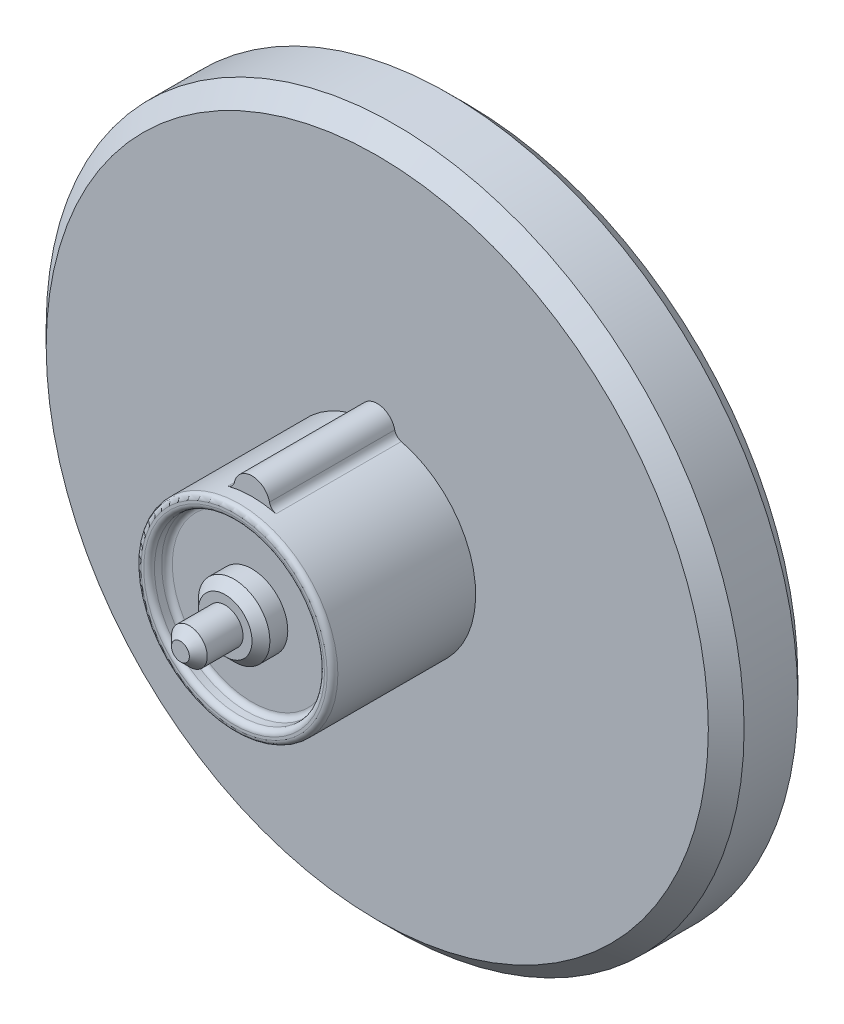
ISO-10303-21;
HEADER;
FILE_DESCRIPTION(('STEP AP214'),'2;1');
FILE_NAME('part.step','',(''),(''),'','','');
FILE_SCHEMA(('AUTOMOTIVE_DESIGN { 1 0 10303 214 1 1 1 1 }'));
ENDSEC;
DATA;
#1=APPLICATION_CONTEXT('core data for automotive mechanical design processes');
#2=APPLICATION_PROTOCOL_DEFINITION('international standard','automotive_design',2000,#1);
#3=PRODUCT_CONTEXT('',#1,'mechanical');
#4=PRODUCT('Part','Part','',(#3));
#5=PRODUCT_RELATED_PRODUCT_CATEGORY('part','',(#4));
#6=PRODUCT_DEFINITION_FORMATION('','',#4);
#7=PRODUCT_DEFINITION_CONTEXT('part definition',#1,'design');
#8=PRODUCT_DEFINITION('design','',#6,#7);
#9=PRODUCT_DEFINITION_SHAPE('','',#8);
#10=(LENGTH_UNIT() NAMED_UNIT(*) SI_UNIT(.MILLI.,.METRE.));
#11=(NAMED_UNIT(*) PLANE_ANGLE_UNIT() SI_UNIT($,.RADIAN.));
#12=(NAMED_UNIT(*) SI_UNIT($,.STERADIAN.) SOLID_ANGLE_UNIT());
#13=UNCERTAINTY_MEASURE_WITH_UNIT(LENGTH_MEASURE(1.E-05),#10,'distance_accuracy_value','');
#14=(GEOMETRIC_REPRESENTATION_CONTEXT(3) GLOBAL_UNCERTAINTY_ASSIGNED_CONTEXT((#13)) GLOBAL_UNIT_ASSIGNED_CONTEXT((#10,
#11,#12)) REPRESENTATION_CONTEXT('',''));
#15=CARTESIAN_POINT('',(0.,0.,0.));
#16=DIRECTION('',(0.,0.,1.));
#17=DIRECTION('',(1.,0.,0.));
#18=AXIS2_PLACEMENT_3D('',#15,#16,#17);
#19=CARTESIAN_POINT('',(0.,0.,8.));
#20=DIRECTION('',(0.,0.,1.));
#21=DIRECTION('',(1.,0.,0.));
#22=AXIS2_PLACEMENT_3D('',#19,#20,#21);
#23=PLANE('',#22);
#24=CARTESIAN_POINT('',(0.,0.,8.));
#25=DIRECTION('',(0.,0.,1.));
#26=DIRECTION('',(1.,0.,0.));
#27=AXIS2_PLACEMENT_3D('',#24,#25,#26);
#28=CIRCLE('',#27,18.5);
#29=CARTESIAN_POINT('',(18.5,0.,8.));
#30=VERTEX_POINT('',#29);
#31=EDGE_CURVE('E490',#30,#30,#28,.F.);
#32=ORIENTED_EDGE('',*,*,#31,.T.);
#33=EDGE_LOOP('',(#32));
#34=FACE_BOUND('',#33,.T.);
#35=CARTESIAN_POINT('',(0.,0.,8.));
#36=DIRECTION('',(0.,0.,1.));
#37=DIRECTION('',(1.,0.,0.));
#38=AXIS2_PLACEMENT_3D('',#35,#36,#37);
#39=CIRCLE('',#38,9.);
#40=CARTESIAN_POINT('',(9.,0.,8.));
#41=VERTEX_POINT('',#40);
#42=EDGE_CURVE('E552',#41,#41,#39,.F.);
#43=ORIENTED_EDGE('',*,*,#42,.F.);
#44=EDGE_LOOP('',(#43));
#45=FACE_BOUND('',#44,.T.);
#46=ADVANCED_FACE('F31',(#34,#45),#23,.F.);
#47=CARTESIAN_POINT('',(0.,0.,20.));
#48=DIRECTION('',(0.,0.,1.));
#49=DIRECTION('',(1.,0.,0.));
#50=AXIS2_PLACEMENT_3D('',#47,#48,#49);
#51=PLANE('',#50);
#52=CARTESIAN_POINT('',(0.,0.,20.));
#53=DIRECTION('',(0.,0.,1.));
#54=DIRECTION('',(1.,0.,0.));
#55=AXIS2_PLACEMENT_3D('',#52,#53,#54);
#56=CIRCLE('',#55,4.45);
#57=CARTESIAN_POINT('',(4.45,0.,20.));
#58=VERTEX_POINT('',#57);
#59=EDGE_CURVE('E510',#58,#58,#56,.T.);
#60=ORIENTED_EDGE('',*,*,#59,.T.);
#61=EDGE_LOOP('',(#60));
#62=FACE_BOUND('',#61,.T.);
#63=CARTESIAN_POINT('',(0.,0.,20.));
#64=DIRECTION('',(0.,0.,1.));
#65=DIRECTION('',(1.,0.,0.));
#66=AXIS2_PLACEMENT_3D('',#63,#64,#65);
#67=CIRCLE('',#66,2.);
#68=CARTESIAN_POINT('',(2.,0.,20.));
#69=VERTEX_POINT('',#68);
#70=EDGE_CURVE('E540',#69,#69,#67,.T.);
#71=ORIENTED_EDGE('',*,*,#70,.F.);
#72=EDGE_LOOP('',(#71));
#73=FACE_BOUND('',#72,.T.);
#74=ADVANCED_FACE('F441',(#62,#73),#51,.T.);
#75=CARTESIAN_POINT('',(0.,0.,13.));
#76=DIRECTION('',(0.,0.,1.));
#77=DIRECTION('',(1.,0.,0.));
#78=AXIS2_PLACEMENT_3D('',#75,#76,#77);
#79=PLANE('',#78);
#80=CARTESIAN_POINT('',(0.,0.,13.));
#81=DIRECTION('',(0.,0.,1.));
#82=DIRECTION('',(1.,0.,0.));
#83=AXIS2_PLACEMENT_3D('',#80,#81,#82);
#84=CIRCLE('',#83,18.5);
#85=CARTESIAN_POINT('',(18.5,0.,13.));
#86=VERTEX_POINT('',#85);
#87=EDGE_CURVE('E492',#86,#86,#84,.T.);
#88=ORIENTED_EDGE('',*,*,#87,.T.);
#89=EDGE_LOOP('',(#88));
#90=FACE_BOUND('',#89,.T.);
#91=CARTESIAN_POINT('',(0.,0.,13.));
#92=DIRECTION('',(0.,0.,1.));
#93=DIRECTION('',(1.,0.,0.));
#94=AXIS2_PLACEMENT_3D('',#91,#92,#93);
#95=CIRCLE('',#94,5.5);
#96=CARTESIAN_POINT('',(-1.34370962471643,5.33333333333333,13.));
#97=VERTEX_POINT('',#96);
#98=CARTESIAN_POINT('',(1.34370962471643,5.33333333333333,13.));
#99=VERTEX_POINT('',#98);
#100=EDGE_CURVE('E484',#97,#99,#95,.T.);
#101=ORIENTED_EDGE('',*,*,#100,.F.);
#102=CARTESIAN_POINT('',(-1.46586504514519,5.81818181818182,13.));
#103=DIRECTION('',(0.,0.,1.));
#104=DIRECTION('',(1.,0.,0.));
#105=AXIS2_PLACEMENT_3D('',#102,#103,#104);
#106=CIRCLE('',#105,0.5);
#107=CARTESIAN_POINT('',(-0.977243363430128,5.71212121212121,13.));
#108=VERTEX_POINT('',#107);
#109=EDGE_CURVE('E528',#97,#108,#106,.T.);
#110=ORIENTED_EDGE('',*,*,#109,.T.);
#111=CARTESIAN_POINT('',(0.,5.5,13.));
#112=DIRECTION('',(0.,0.,1.));
#113=DIRECTION('',(1.,0.,0.));
#114=AXIS2_PLACEMENT_3D('',#111,#112,#113);
#115=CIRCLE('',#114,1.);
#116=CARTESIAN_POINT('',(0.977243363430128,5.71212121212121,13.));
#117=VERTEX_POINT('',#116);
#118=EDGE_CURVE('E539',#117,#108,#115,.T.);
#119=ORIENTED_EDGE('',*,*,#118,.F.);
#120=CARTESIAN_POINT('',(1.46586504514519,5.81818181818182,13.));
#121=DIRECTION('',(0.,0.,1.));
#122=DIRECTION('',(1.,0.,0.));
#123=AXIS2_PLACEMENT_3D('',#120,#121,#122);
#124=CIRCLE('',#123,0.5);
#125=EDGE_CURVE('E526',#117,#99,#124,.T.);
#126=ORIENTED_EDGE('',*,*,#125,.T.);
#127=EDGE_LOOP('',(#101,#110,#119,#126));
#128=FACE_BOUND('',#127,.T.);
#129=ADVANCED_FACE('F447',(#90,#128),#79,.T.);
#130=CARTESIAN_POINT('',(0.,0.,21.));
#131=DIRECTION('',(0.,0.,-1.));
#132=DIRECTION('',(-1.,0.,0.));
#133=AXIS2_PLACEMENT_3D('',#130,#131,#132);
#134=CYLINDRICAL_SURFACE('',#133,5.5);
#135=CARTESIAN_POINT('',(0.,0.,20.7));
#136=DIRECTION('',(0.,0.,1.));
#137=DIRECTION('',(1.,0.,0.));
#138=AXIS2_PLACEMENT_3D('',#135,#136,#137);
#139=CIRCLE('',#138,5.5);
#140=CARTESIAN_POINT('',(5.5,0.,20.7));
#141=VERTEX_POINT('',#140);
#142=EDGE_CURVE('E507',#141,#141,#139,.F.);
#143=ORIENTED_EDGE('',*,*,#142,.T.);
#144=EDGE_LOOP('',(#143));
#145=FACE_BOUND('',#144,.T.);
#146=CARTESIAN_POINT('',(0.,0.,20.));
#147=DIRECTION('',(0.,0.,1.));
#148=DIRECTION('',(1.,0.,0.));
#149=AXIS2_PLACEMENT_3D('',#146,#147,#148);
#150=CIRCLE('',#149,5.5);
#151=CARTESIAN_POINT('',(1.34370962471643,5.33333333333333,20.));
#152=VERTEX_POINT('',#151);
#153=CARTESIAN_POINT('',(-1.34370962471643,5.33333333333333,20.));
#154=VERTEX_POINT('',#153);
#155=EDGE_CURVE('E513',#152,#154,#150,.T.);
#156=ORIENTED_EDGE('',*,*,#155,.T.);
#157=DIRECTION('',(0.,0.,-1.));
#158=VECTOR('',#157,1.);
#159=CARTESIAN_POINT('',(-1.34370962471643,5.33333333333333,21.));
#160=LINE('',#159,#158);
#161=EDGE_CURVE('E524',#154,#97,#160,.T.);
#162=ORIENTED_EDGE('',*,*,#161,.T.);
#163=ORIENTED_EDGE('',*,*,#100,.T.);
#164=DIRECTION('',(0.,0.,-1.));
#165=VECTOR('',#164,1.);
#166=CARTESIAN_POINT('',(1.34370962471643,5.33333333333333,21.));
#167=LINE('',#166,#165);
#168=EDGE_CURVE('E521',#99,#152,#167,.F.);
#169=ORIENTED_EDGE('',*,*,#168,.T.);
#170=EDGE_LOOP('',(#156,#162,#163,#169));
#171=FACE_BOUND('',#170,.T.);
#172=ADVANCED_FACE('F458',(#145,#171),#134,.T.);
#173=CARTESIAN_POINT('',(0.,0.,13.));
#174=DIRECTION('',(0.,0.,-1.));
#175=DIRECTION('',(-1.,0.,0.));
#176=AXIS2_PLACEMENT_3D('',#173,#174,#175);
#177=CYLINDRICAL_SURFACE('',#176,19.5);
#178=CARTESIAN_POINT('',(0.,0.,9.00000000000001));
#179=DIRECTION('',(0.,0.,1.));
#180=DIRECTION('',(1.,0.,0.));
#181=AXIS2_PLACEMENT_3D('',#178,#179,#180);
#182=CIRCLE('',#181,19.5);
#183=CARTESIAN_POINT('',(19.5,0.,9.00000000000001));
#184=VERTEX_POINT('',#183);
#185=EDGE_CURVE('E481',#184,#184,#182,.T.);
#186=ORIENTED_EDGE('',*,*,#185,.T.);
#187=EDGE_LOOP('',(#186));
#188=FACE_BOUND('',#187,.T.);
#189=CARTESIAN_POINT('',(0.,0.,12.));
#190=DIRECTION('',(0.,0.,1.));
#191=DIRECTION('',(1.,0.,0.));
#192=AXIS2_PLACEMENT_3D('',#189,#190,#191);
#193=CIRCLE('',#192,19.5);
#194=CARTESIAN_POINT('',(19.5,0.,12.));
#195=VERTEX_POINT('',#194);
#196=EDGE_CURVE('E477',#195,#195,#193,.F.);
#197=ORIENTED_EDGE('',*,*,#196,.T.);
#198=EDGE_LOOP('',(#197));
#199=FACE_BOUND('',#198,.T.);
#200=ADVANCED_FACE('F460',(#188,#199),#177,.T.);
#201=CARTESIAN_POINT('',(0.,0.,9.00000000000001));
#202=DIRECTION('',(0.,0.,1.));
#203=DIRECTION('',(1.,0.,0.));
#204=AXIS2_PLACEMENT_3D('',#201,#202,#203);
#205=CONICAL_SURFACE('',#204,19.5,0.785398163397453);
#206=ORIENTED_EDGE('',*,*,#31,.F.);
#207=EDGE_LOOP('',(#206));
#208=FACE_BOUND('',#207,.T.);
#209=ORIENTED_EDGE('',*,*,#185,.F.);
#210=EDGE_LOOP('',(#209));
#211=FACE_BOUND('',#210,.T.);
#212=ADVANCED_FACE('F454',(#208,#211),#205,.T.);
#213=CARTESIAN_POINT('',(0.,0.,13.));
#214=DIRECTION('',(0.,0.,-1.));
#215=DIRECTION('',(-1.,0.,0.));
#216=AXIS2_PLACEMENT_3D('',#213,#214,#215);
#217=CONICAL_SURFACE('',#216,18.5,0.785398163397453);
#218=ORIENTED_EDGE('',*,*,#196,.F.);
#219=EDGE_LOOP('',(#218));
#220=FACE_BOUND('',#219,.T.);
#221=ORIENTED_EDGE('',*,*,#87,.F.);
#222=EDGE_LOOP('',(#221));
#223=FACE_BOUND('',#222,.T.);
#224=ADVANCED_FACE('F942',(#220,#223),#217,.T.);
#225=CARTESIAN_POINT('',(0.,0.,21.));
#226=DIRECTION('',(0.,0.,1.));
#227=DIRECTION('',(1.,0.,0.));
#228=AXIS2_PLACEMENT_3D('',#225,#226,#227);
#229=PLANE('',#228);
#230=CARTESIAN_POINT('',(0.,0.,21.));
#231=DIRECTION('',(0.,0.,1.));
#232=DIRECTION('',(1.,0.,0.));
#233=AXIS2_PLACEMENT_3D('',#230,#231,#232);
#234=CIRCLE('',#233,5.05);
#235=CARTESIAN_POINT('',(5.05,0.,21.));
#236=VERTEX_POINT('',#235);
#237=EDGE_CURVE('E504',#236,#236,#234,.F.);
#238=ORIENTED_EDGE('',*,*,#237,.T.);
#239=EDGE_LOOP('',(#238));
#240=FACE_BOUND('',#239,.T.);
#241=CARTESIAN_POINT('',(0.,0.,21.));
#242=DIRECTION('',(0.,0.,1.));
#243=DIRECTION('',(1.,0.,0.));
#244=AXIS2_PLACEMENT_3D('',#241,#242,#243);
#245=CIRCLE('',#244,5.2);
#246=CARTESIAN_POINT('',(5.2,0.,21.));
#247=VERTEX_POINT('',#246);
#248=EDGE_CURVE('E501',#247,#247,#245,.T.);
#249=ORIENTED_EDGE('',*,*,#248,.T.);
#250=EDGE_LOOP('',(#249));
#251=FACE_BOUND('',#250,.T.);
#252=ADVANCED_FACE('F938',(#240,#251),#229,.T.);
#253=CARTESIAN_POINT('',(0.,0.,20.));
#254=DIRECTION('',(0.,0.,1.));
#255=DIRECTION('',(1.,0.,0.));
#256=AXIS2_PLACEMENT_3D('',#253,#254,#255);
#257=CYLINDRICAL_SURFACE('',#256,4.75);
#258=CARTESIAN_POINT('',(0.,0.,20.7));
#259=DIRECTION('',(0.,0.,1.));
#260=DIRECTION('',(1.,0.,0.));
#261=AXIS2_PLACEMENT_3D('',#258,#259,#260);
#262=CIRCLE('',#261,4.75);
#263=CARTESIAN_POINT('',(4.75,0.,20.7));
#264=VERTEX_POINT('',#263);
#265=EDGE_CURVE('E498',#264,#264,#262,.T.);
#266=ORIENTED_EDGE('',*,*,#265,.T.);
#267=EDGE_LOOP('',(#266));
#268=FACE_BOUND('',#267,.T.);
#269=CARTESIAN_POINT('',(0.,0.,20.3));
#270=DIRECTION('',(0.,0.,1.));
#271=DIRECTION('',(1.,0.,0.));
#272=AXIS2_PLACEMENT_3D('',#269,#270,#271);
#273=CIRCLE('',#272,4.75);
#274=CARTESIAN_POINT('',(4.75,0.,20.3));
#275=VERTEX_POINT('',#274);
#276=EDGE_CURVE('E495',#275,#275,#273,.F.);
#277=ORIENTED_EDGE('',*,*,#276,.T.);
#278=EDGE_LOOP('',(#277));
#279=FACE_BOUND('',#278,.T.);
#280=ADVANCED_FACE('F933',(#268,#279),#257,.F.);
#281=CARTESIAN_POINT('',(0.,0.,20.7));
#282=DIRECTION('',(0.,0.,1.));
#283=DIRECTION('',(1.,0.,0.));
#284=AXIS2_PLACEMENT_3D('',#281,#282,#283);
#285=TOROIDAL_SURFACE('',#284,5.05,0.3);
#286=ORIENTED_EDGE('',*,*,#237,.F.);
#287=EDGE_LOOP('',(#286));
#288=FACE_BOUND('',#287,.T.);
#289=ORIENTED_EDGE('',*,*,#265,.F.);
#290=EDGE_LOOP('',(#289));
#291=FACE_BOUND('',#290,.T.);
#292=ADVANCED_FACE('F930',(#288,#291),#285,.T.);
#293=CARTESIAN_POINT('',(0.,0.,20.7));
#294=DIRECTION('',(0.,0.,1.));
#295=DIRECTION('',(1.,0.,0.));
#296=AXIS2_PLACEMENT_3D('',#293,#294,#295);
#297=TOROIDAL_SURFACE('',#296,5.2,0.3);
#298=ORIENTED_EDGE('',*,*,#142,.F.);
#299=EDGE_LOOP('',(#298));
#300=FACE_BOUND('',#299,.T.);
#301=ORIENTED_EDGE('',*,*,#248,.F.);
#302=EDGE_LOOP('',(#301));
#303=FACE_BOUND('',#302,.T.);
#304=ADVANCED_FACE('F926',(#300,#303),#297,.T.);
#305=CARTESIAN_POINT('',(0.,0.,20.3));
#306=DIRECTION('',(0.,0.,1.));
#307=DIRECTION('',(1.,0.,0.));
#308=AXIS2_PLACEMENT_3D('',#305,#306,#307);
#309=TOROIDAL_SURFACE('',#308,4.45,0.3);
#310=ORIENTED_EDGE('',*,*,#276,.F.);
#311=EDGE_LOOP('',(#310));
#312=FACE_BOUND('',#311,.T.);
#313=ORIENTED_EDGE('',*,*,#59,.F.);
#314=EDGE_LOOP('',(#313));
#315=FACE_BOUND('',#314,.T.);
#316=ADVANCED_FACE('F922',(#312,#315),#309,.F.);
#317=CARTESIAN_POINT('',(0.,5.5,20.));
#318=DIRECTION('',(0.,0.,-1.));
#319=DIRECTION('',(-1.,0.,0.));
#320=AXIS2_PLACEMENT_3D('',#317,#318,#319);
#321=CYLINDRICAL_SURFACE('',#320,1.);
#322=ORIENTED_EDGE('',*,*,#118,.T.);
#323=DIRECTION('',(0.,0.,-1.));
#324=VECTOR('',#323,1.);
#325=CARTESIAN_POINT('',(-0.977243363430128,5.71212121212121,20.));
#326=LINE('',#325,#324);
#327=CARTESIAN_POINT('',(-0.977243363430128,5.71212121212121,20.));
#328=VERTEX_POINT('',#327);
#329=EDGE_CURVE('E518',#108,#328,#326,.F.);
#330=ORIENTED_EDGE('',*,*,#329,.T.);
#331=CARTESIAN_POINT('',(0.,5.5,20.));
#332=DIRECTION('',(0.,0.,1.));
#333=DIRECTION('',(1.,0.,0.));
#334=AXIS2_PLACEMENT_3D('',#331,#332,#333);
#335=CIRCLE('',#334,1.);
#336=CARTESIAN_POINT('',(0.977243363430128,5.71212121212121,20.));
#337=VERTEX_POINT('',#336);
#338=EDGE_CURVE('E963',#337,#328,#335,.T.);
#339=ORIENTED_EDGE('',*,*,#338,.F.);
#340=DIRECTION('',(0.,0.,-1.));
#341=VECTOR('',#340,1.);
#342=CARTESIAN_POINT('',(0.977243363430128,5.71212121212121,20.));
#343=LINE('',#342,#341);
#344=EDGE_CURVE('E515',#337,#117,#343,.T.);
#345=ORIENTED_EDGE('',*,*,#344,.T.);
#346=EDGE_LOOP('',(#322,#330,#339,#345));
#347=FACE_BOUND('',#346,.T.);
#348=ADVANCED_FACE('F918',(#347),#321,.T.);
#349=CARTESIAN_POINT('',(0.,5.5,20.));
#350=DIRECTION('',(0.,0.,1.));
#351=DIRECTION('',(1.,0.,0.));
#352=AXIS2_PLACEMENT_3D('',#349,#350,#351);
#353=PLANE('',#352);
#354=ORIENTED_EDGE('',*,*,#155,.F.);
#355=CARTESIAN_POINT('',(1.46586504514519,5.81818181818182,20.));
#356=DIRECTION('',(0.,0.,1.));
#357=DIRECTION('',(1.,0.,0.));
#358=AXIS2_PLACEMENT_3D('',#355,#356,#357);
#359=CIRCLE('',#358,0.5);
#360=EDGE_CURVE('E533',#152,#337,#359,.F.);
#361=ORIENTED_EDGE('',*,*,#360,.T.);
#362=ORIENTED_EDGE('',*,*,#338,.T.);
#363=CARTESIAN_POINT('',(-1.46586504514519,5.81818181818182,20.));
#364=DIRECTION('',(0.,0.,1.));
#365=DIRECTION('',(1.,0.,0.));
#366=AXIS2_PLACEMENT_3D('',#363,#364,#365);
#367=CIRCLE('',#366,0.5);
#368=EDGE_CURVE('E530',#328,#154,#367,.F.);
#369=ORIENTED_EDGE('',*,*,#368,.T.);
#370=EDGE_LOOP('',(#354,#361,#362,#369));
#371=FACE_BOUND('',#370,.T.);
#372=ADVANCED_FACE('F914',(#371),#353,.T.);
#373=CARTESIAN_POINT('',(-1.46586504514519,5.81818181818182,21.));
#374=DIRECTION('',(0.,0.,-1.));
#375=DIRECTION('',(-1.,0.,0.));
#376=AXIS2_PLACEMENT_3D('',#373,#374,#375);
#377=CYLINDRICAL_SURFACE('',#376,0.5);
#378=ORIENTED_EDGE('',*,*,#109,.F.);
#379=ORIENTED_EDGE('',*,*,#161,.F.);
#380=ORIENTED_EDGE('',*,*,#368,.F.);
#381=ORIENTED_EDGE('',*,*,#329,.F.);
#382=EDGE_LOOP('',(#378,#379,#380,#381));
#383=FACE_BOUND('',#382,.T.);
#384=ADVANCED_FACE('F910',(#383),#377,.F.);
#385=CARTESIAN_POINT('',(1.46586504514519,5.81818181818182,21.));
#386=DIRECTION('',(0.,0.,1.));
#387=DIRECTION('',(1.,0.,0.));
#388=AXIS2_PLACEMENT_3D('',#385,#386,#387);
#389=CYLINDRICAL_SURFACE('',#388,0.5);
#390=ORIENTED_EDGE('',*,*,#360,.F.);
#391=ORIENTED_EDGE('',*,*,#168,.F.);
#392=ORIENTED_EDGE('',*,*,#125,.F.);
#393=ORIENTED_EDGE('',*,*,#344,.F.);
#394=EDGE_LOOP('',(#390,#391,#392,#393));
#395=FACE_BOUND('',#394,.T.);
#396=ADVANCED_FACE('F896',(#395),#389,.F.);
#397=CARTESIAN_POINT('',(0.,0.,21.5));
#398=DIRECTION('',(0.,0.,1.));
#399=DIRECTION('',(1.,0.,0.));
#400=AXIS2_PLACEMENT_3D('',#397,#398,#399);
#401=PLANE('',#400);
#402=CARTESIAN_POINT('',(0.,0.,21.5));
#403=DIRECTION('',(0.,0.,1.));
#404=DIRECTION('',(1.,0.,0.));
#405=AXIS2_PLACEMENT_3D('',#402,#403,#404);
#406=CIRCLE('',#405,1.49999999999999);
#407=CARTESIAN_POINT('',(1.49999999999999,0.,21.5));
#408=VERTEX_POINT('',#407);
#409=EDGE_CURVE('E535',#408,#408,#406,.T.);
#410=ORIENTED_EDGE('',*,*,#409,.T.);
#411=EDGE_LOOP('',(#410));
#412=FACE_BOUND('',#411,.T.);
#413=CARTESIAN_POINT('',(0.,0.,21.5));
#414=DIRECTION('',(0.,0.,1.));
#415=DIRECTION('',(1.,0.,0.));
#416=AXIS2_PLACEMENT_3D('',#413,#414,#415);
#417=CIRCLE('',#416,0.999999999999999);
#418=CARTESIAN_POINT('',(0.999999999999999,0.,21.5));
#419=VERTEX_POINT('',#418);
#420=EDGE_CURVE('E536',#419,#419,#417,.T.);
#421=ORIENTED_EDGE('',*,*,#420,.F.);
#422=EDGE_LOOP('',(#421));
#423=FACE_BOUND('',#422,.T.);
#424=ADVANCED_FACE('F892',(#412,#423),#401,.T.);
#425=CARTESIAN_POINT('',(0.,0.,21.5));
#426=DIRECTION('',(0.,0.,-1.));
#427=DIRECTION('',(-1.,0.,0.));
#428=AXIS2_PLACEMENT_3D('',#425,#426,#427);
#429=CYLINDRICAL_SURFACE('',#428,2.);
#430=CARTESIAN_POINT('',(0.,0.,21.));
#431=DIRECTION('',(0.,0.,1.));
#432=DIRECTION('',(1.,0.,0.));
#433=AXIS2_PLACEMENT_3D('',#430,#431,#432);
#434=CIRCLE('',#433,2.);
#435=CARTESIAN_POINT('',(2.,0.,21.));
#436=VERTEX_POINT('',#435);
#437=EDGE_CURVE('E543',#436,#436,#434,.F.);
#438=ORIENTED_EDGE('',*,*,#437,.T.);
#439=EDGE_LOOP('',(#438));
#440=FACE_BOUND('',#439,.T.);
#441=ORIENTED_EDGE('',*,*,#70,.T.);
#442=EDGE_LOOP('',(#441));
#443=FACE_BOUND('',#442,.T.);
#444=ADVANCED_FACE('F895',(#440,#443),#429,.T.);
#445=CARTESIAN_POINT('',(0.,0.,24.));
#446=DIRECTION('',(0.,0.,1.));
#447=DIRECTION('',(1.,0.,0.));
#448=AXIS2_PLACEMENT_3D('',#445,#446,#447);
#449=PLANE('',#448);
#450=CARTESIAN_POINT('',(0.,0.,24.));
#451=DIRECTION('',(0.,0.,1.));
#452=DIRECTION('',(1.,0.,0.));
#453=AXIS2_PLACEMENT_3D('',#450,#451,#452);
#454=CIRCLE('',#453,0.49999999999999);
#455=CARTESIAN_POINT('',(0.49999999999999,0.,24.));
#456=VERTEX_POINT('',#455);
#457=EDGE_CURVE('E546',#456,#456,#454,.T.);
#458=ORIENTED_EDGE('',*,*,#457,.T.);
#459=EDGE_LOOP('',(#458));
#460=FACE_BOUND('',#459,.T.);
#461=ADVANCED_FACE('F900',(#460),#449,.T.);
#462=CARTESIAN_POINT('',(0.,0.,24.));
#463=DIRECTION('',(0.,0.,-1.));
#464=DIRECTION('',(-1.,0.,0.));
#465=AXIS2_PLACEMENT_3D('',#462,#463,#464);
#466=CYLINDRICAL_SURFACE('',#465,0.999999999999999);
#467=CARTESIAN_POINT('',(0.,0.,23.5));
#468=DIRECTION('',(0.,0.,1.));
#469=DIRECTION('',(1.,0.,0.));
#470=AXIS2_PLACEMENT_3D('',#467,#468,#469);
#471=CIRCLE('',#470,0.999999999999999);
#472=CARTESIAN_POINT('',(0.999999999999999,0.,23.5));
#473=VERTEX_POINT('',#472);
#474=EDGE_CURVE('E549',#473,#473,#471,.F.);
#475=ORIENTED_EDGE('',*,*,#474,.T.);
#476=EDGE_LOOP('',(#475));
#477=FACE_BOUND('',#476,.T.);
#478=ORIENTED_EDGE('',*,*,#420,.T.);
#479=EDGE_LOOP('',(#478));
#480=FACE_BOUND('',#479,.T.);
#481=ADVANCED_FACE('F890',(#477,#480),#466,.T.);
#482=CARTESIAN_POINT('',(0.,0.,21.5));
#483=DIRECTION('',(0.,0.,-1.));
#484=DIRECTION('',(-1.,0.,0.));
#485=AXIS2_PLACEMENT_3D('',#482,#483,#484);
#486=CONICAL_SURFACE('',#485,1.49999999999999,0.785398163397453);
#487=ORIENTED_EDGE('',*,*,#437,.F.);
#488=EDGE_LOOP('',(#487));
#489=FACE_BOUND('',#488,.T.);
#490=ORIENTED_EDGE('',*,*,#409,.F.);
#491=EDGE_LOOP('',(#490));
#492=FACE_BOUND('',#491,.T.);
#493=ADVANCED_FACE('F886',(#489,#492),#486,.T.);
#494=CARTESIAN_POINT('',(0.,0.,24.));
#495=DIRECTION('',(0.,0.,-1.));
#496=DIRECTION('',(-1.,0.,0.));
#497=AXIS2_PLACEMENT_3D('',#494,#495,#496);
#498=CONICAL_SURFACE('',#497,0.49999999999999,0.785398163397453);
#499=ORIENTED_EDGE('',*,*,#474,.F.);
#500=EDGE_LOOP('',(#499));
#501=FACE_BOUND('',#500,.T.);
#502=ORIENTED_EDGE('',*,*,#457,.F.);
#503=EDGE_LOOP('',(#502));
#504=FACE_BOUND('',#503,.T.);
#505=ADVANCED_FACE('F880',(#501,#504),#498,.T.);
#506=CARTESIAN_POINT('',(0.,0.,7.5));
#507=DIRECTION('',(0.,0.,-1.));
#508=DIRECTION('',(-1.,0.,0.));
#509=AXIS2_PLACEMENT_3D('',#506,#507,#508);
#510=PLANE('',#509);
#511=DIRECTION('',(0.695416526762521,-0.718606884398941,0.));
#512=VECTOR('',#511,1.);
#513=CARTESIAN_POINT('',(8.50000000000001,1.99999999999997,7.5));
#514=LINE('',#513,#512);
#515=CARTESIAN_POINT('',(5.44012186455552,5.16191722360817,7.5));
#516=VERTEX_POINT('',#515);
#517=CARTESIAN_POINT('',(8.35930344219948,2.14538842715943,7.5));
#518=VERTEX_POINT('',#517);
#519=EDGE_CURVE('E1026',#516,#518,#514,.T.);
#520=ORIENTED_EDGE('',*,*,#519,.F.);
#521=CARTESIAN_POINT('',(5.58384324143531,5.30100052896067,7.5));
#522=DIRECTION('',(0.,0.,-1.));
#523=DIRECTION('',(-1.,0.,0.));
#524=AXIS2_PLACEMENT_3D('',#521,#522,#523);
#525=CIRCLE('',#524,0.2);
#526=CARTESIAN_POINT('',(5.442421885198,5.44242188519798,7.5));
#527=VERTEX_POINT('',#526);
#528=EDGE_CURVE('E659',#516,#527,#525,.T.);
#529=ORIENTED_EDGE('',*,*,#528,.T.);
#530=DIRECTION('',(-0.707106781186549,-0.707106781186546,0.));
#531=VECTOR('',#530,1.);
#532=CARTESIAN_POINT('',(0.883883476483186,0.883883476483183,7.5));
#533=LINE('',#532,#531);
#534=CARTESIAN_POINT('',(6.01040764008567,6.01040764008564,7.5));
#535=VERTEX_POINT('',#534);
#536=EDGE_CURVE('E1004',#535,#527,#533,.T.);
#537=ORIENTED_EDGE('',*,*,#536,.F.);
#538=DIRECTION('',(0.707106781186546,-0.707106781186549,0.));
#539=VECTOR('',#538,1.);
#540=CARTESIAN_POINT('',(6.01040764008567,6.01040764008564,7.5));
#541=LINE('',#540,#539);
#542=CARTESIAN_POINT('',(4.73925580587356,7.28155947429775,7.5));
#543=VERTEX_POINT('',#542);
#544=EDGE_CURVE('E1007',#543,#535,#541,.T.);
#545=ORIENTED_EDGE('',*,*,#544,.F.);
#546=CARTESIAN_POINT('',(4.38570241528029,6.92800608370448,7.5));
#547=DIRECTION('',(0.,0.,-1.));
#548=DIRECTION('',(-1.,0.,0.));
#549=AXIS2_PLACEMENT_3D('',#546,#547,#548);
#550=CIRCLE('',#549,0.5);
#551=CARTESIAN_POINT('',(4.39390144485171,7.42793885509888,7.5));
#552=VERTEX_POINT('',#551);
#553=EDGE_CURVE('E574',#543,#552,#550,.F.);
#554=ORIENTED_EDGE('',*,*,#553,.T.);
#555=DIRECTION('',(0.999865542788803,-0.0163980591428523,0.));
#556=VECTOR('',#555,1.);
#557=CARTESIAN_POINT('',(4.59619407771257,7.42462120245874,7.5));
#558=LINE('',#557,#556);
#559=CARTESIAN_POINT('',(0.196720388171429,7.49677373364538,7.5));
#560=VERTEX_POINT('',#559);
#561=EDGE_CURVE('E1009',#560,#552,#558,.T.);
#562=ORIENTED_EDGE('',*,*,#561,.F.);
#563=CARTESIAN_POINT('',(0.2,7.69674684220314,7.5));
#564=DIRECTION('',(0.,0.,-1.));
#565=DIRECTION('',(-1.,0.,0.));
#566=AXIS2_PLACEMENT_3D('',#563,#564,#565);
#567=CIRCLE('',#566,0.2);
#568=CARTESIAN_POINT('',(0.,7.69674684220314,7.5));
#569=VERTEX_POINT('',#568);
#570=EDGE_CURVE('E644',#560,#569,#567,.T.);
#571=ORIENTED_EDGE('',*,*,#570,.T.);
#572=DIRECTION('',(0.,-1.,0.));
#573=VECTOR('',#572,1.);
#574=CARTESIAN_POINT('',(0.,1.25,7.5));
#575=LINE('',#574,#573);
#576=CARTESIAN_POINT('',(0.,8.5,7.5));
#577=VERTEX_POINT('',#576);
#578=EDGE_CURVE('E988',#577,#569,#575,.T.);
#579=ORIENTED_EDGE('',*,*,#578,.F.);
#580=DIRECTION('',(1.,0.,0.));
#581=VECTOR('',#580,1.);
#582=CARTESIAN_POINT('',(0.,8.5,7.5));
#583=LINE('',#582,#581);
#584=CARTESIAN_POINT('',(-1.79768016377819,8.5,7.5));
#585=VERTEX_POINT('',#584);
#586=EDGE_CURVE('E990',#585,#577,#583,.T.);
#587=ORIENTED_EDGE('',*,*,#586,.F.);
#588=CARTESIAN_POINT('',(-1.79768016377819,8.,7.5));
#589=DIRECTION('',(0.,0.,-1.));
#590=DIRECTION('',(-1.,0.,0.));
#591=AXIS2_PLACEMENT_3D('',#588,#589,#590);
#592=CIRCLE('',#591,0.5);
#593=CARTESIAN_POINT('',(-2.14538842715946,8.35930344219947,7.5));
#594=VERTEX_POINT('',#593);
#595=EDGE_CURVE('E563',#585,#594,#592,.F.);
#596=ORIENTED_EDGE('',*,*,#595,.T.);
#597=DIRECTION('',(0.718606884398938,0.695416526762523,0.));
#598=VECTOR('',#597,1.);
#599=CARTESIAN_POINT('',(-2.,8.5,7.5));
#600=LINE('',#599,#598);
#601=CARTESIAN_POINT('',(-5.16191722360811,5.44012186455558,7.5));
#602=VERTEX_POINT('',#601);
#603=EDGE_CURVE('E992',#602,#594,#600,.T.);
#604=ORIENTED_EDGE('',*,*,#603,.F.);
#605=CARTESIAN_POINT('',(-5.30100052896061,5.58384324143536,7.5));
#606=DIRECTION('',(0.,0.,-1.));
#607=DIRECTION('',(-1.,0.,0.));
#608=AXIS2_PLACEMENT_3D('',#605,#606,#607);
#609=CIRCLE('',#608,0.2);
#610=CARTESIAN_POINT('',(-5.44242188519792,5.44242188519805,7.5));
#611=VERTEX_POINT('',#610);
#612=EDGE_CURVE('E336',#602,#611,#609,.T.);
#613=ORIENTED_EDGE('',*,*,#612,.T.);
#614=DIRECTION('',(0.707106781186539,-0.707106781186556,0.));
#615=VECTOR('',#614,1.);
#616=CARTESIAN_POINT('',(-0.883883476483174,0.883883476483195,7.5));
#617=LINE('',#616,#615);
#618=CARTESIAN_POINT('',(-6.01040764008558,6.01040764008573,7.5));
#619=VERTEX_POINT('',#618);
#620=EDGE_CURVE('E325',#619,#611,#617,.T.);
#621=ORIENTED_EDGE('',*,*,#620,.F.);
#622=DIRECTION('',(0.707106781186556,0.707106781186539,0.));
#623=VECTOR('',#622,1.);
#624=CARTESIAN_POINT('',(-6.01040764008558,6.01040764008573,7.5));
#625=LINE('',#624,#623);
#626=CARTESIAN_POINT('',(-7.2815594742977,4.73925580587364,7.5));
#627=VERTEX_POINT('',#626);
#628=EDGE_CURVE('E315',#627,#619,#625,.T.);
#629=ORIENTED_EDGE('',*,*,#628,.F.);
#630=CARTESIAN_POINT('',(-6.92800608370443,4.38570241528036,7.5));
#631=DIRECTION('',(0.,0.,-1.));
#632=DIRECTION('',(-1.,0.,0.));
#633=AXIS2_PLACEMENT_3D('',#630,#631,#632);
#634=CIRCLE('',#633,0.5);
#635=CARTESIAN_POINT('',(-7.42793885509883,4.39390144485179,7.5));
#636=VERTEX_POINT('',#635);
#637=EDGE_CURVE('E637',#627,#636,#634,.F.);
#638=ORIENTED_EDGE('',*,*,#637,.T.);
#639=DIRECTION('',(0.0163980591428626,0.999865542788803,0.));
#640=VECTOR('',#639,1.);
#641=CARTESIAN_POINT('',(-7.42462120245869,4.59619407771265,7.5));
#642=LINE('',#641,#640);
#643=CARTESIAN_POINT('',(-7.49677373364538,0.196720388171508,7.5));
#644=VERTEX_POINT('',#643);
#645=EDGE_CURVE('E326',#644,#636,#642,.T.);
#646=ORIENTED_EDGE('',*,*,#645,.F.);
#647=CARTESIAN_POINT('',(-7.69674684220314,0.200000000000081,7.5));
#648=DIRECTION('',(0.,0.,-1.));
#649=DIRECTION('',(-1.,0.,0.));
#650=AXIS2_PLACEMENT_3D('',#647,#648,#649);
#651=CIRCLE('',#650,0.2);
#652=CARTESIAN_POINT('',(-7.69674684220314,0.,7.5));
#653=VERTEX_POINT('',#652);
#654=EDGE_CURVE('E645',#644,#653,#651,.T.);
#655=ORIENTED_EDGE('',*,*,#654,.T.);
#656=DIRECTION('',(1.,0.,0.));
#657=VECTOR('',#656,1.);
#658=CARTESIAN_POINT('',(-1.25,0.,7.5));
#659=LINE('',#658,#657);
#660=CARTESIAN_POINT('',(-8.5,0.,7.5));
#661=VERTEX_POINT('',#660);
#662=EDGE_CURVE('E347',#661,#653,#659,.T.);
#663=ORIENTED_EDGE('',*,*,#662,.F.);
#664=DIRECTION('',(0.,1.,0.));
#665=VECTOR('',#664,1.);
#666=CARTESIAN_POINT('',(-8.5,0.,7.5));
#667=LINE('',#666,#665);
#668=CARTESIAN_POINT('',(-8.50000000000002,-1.79768016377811,7.5));
#669=VERTEX_POINT('',#668);
#670=EDGE_CURVE('E345',#669,#661,#667,.T.);
#671=ORIENTED_EDGE('',*,*,#670,.F.);
#672=CARTESIAN_POINT('',(-8.00000000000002,-1.79768016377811,7.5));
#673=DIRECTION('',(0.,0.,-1.));
#674=DIRECTION('',(-1.,0.,0.));
#675=AXIS2_PLACEMENT_3D('',#672,#673,#674);
#676=CIRCLE('',#675,0.5);
#677=CARTESIAN_POINT('',(-8.35930344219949,-2.14538842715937,7.5));
#678=VERTEX_POINT('',#677);
#679=EDGE_CURVE('E629',#669,#678,#676,.F.);
#680=ORIENTED_EDGE('',*,*,#679,.T.);
#681=DIRECTION('',(-0.695416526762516,0.718606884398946,0.));
#682=VECTOR('',#681,1.);
#683=CARTESIAN_POINT('',(-8.50000000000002,-1.99999999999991,7.5));
#684=LINE('',#683,#682);
#685=CARTESIAN_POINT('',(-5.44012186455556,-5.16191722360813,7.5));
#686=VERTEX_POINT('',#685);
#687=EDGE_CURVE('E330',#686,#678,#684,.T.);
#688=ORIENTED_EDGE('',*,*,#687,.F.);
#689=CARTESIAN_POINT('',(-5.58384324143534,-5.30100052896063,7.5));
#690=DIRECTION('',(0.,0.,-1.));
#691=DIRECTION('',(-1.,0.,0.));
#692=AXIS2_PLACEMENT_3D('',#689,#690,#691);
#693=CIRCLE('',#692,0.2);
#694=CARTESIAN_POINT('',(-5.44242188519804,-5.44242188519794,7.5));
#695=VERTEX_POINT('',#694);
#696=EDGE_CURVE('E649',#686,#695,#693,.T.);
#697=ORIENTED_EDGE('',*,*,#696,.T.);
#698=DIRECTION('',(0.707106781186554,0.707106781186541,0.));
#699=VECTOR('',#698,1.);
#700=CARTESIAN_POINT('',(-0.883883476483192,-0.883883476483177,7.5));
#701=LINE('',#700,#699);
#702=CARTESIAN_POINT('',(-6.01040764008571,-6.0104076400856,7.5));
#703=VERTEX_POINT('',#702);
#704=EDGE_CURVE('E702',#703,#695,#701,.T.);
#705=ORIENTED_EDGE('',*,*,#704,.F.);
#706=DIRECTION('',(-0.707106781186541,0.707106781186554,0.));
#707=VECTOR('',#706,1.);
#708=CARTESIAN_POINT('',(-6.01040764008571,-6.0104076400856,7.5));
#709=LINE('',#708,#707);
#710=CARTESIAN_POINT('',(-4.73925580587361,-7.28155947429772,7.5));
#711=VERTEX_POINT('',#710);
#712=EDGE_CURVE('E701',#711,#703,#709,.T.);
#713=ORIENTED_EDGE('',*,*,#712,.F.);
#714=CARTESIAN_POINT('',(-4.38570241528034,-6.92800608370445,7.5));
#715=DIRECTION('',(0.,0.,-1.));
#716=DIRECTION('',(-1.,0.,0.));
#717=AXIS2_PLACEMENT_3D('',#714,#715,#716);
#718=CIRCLE('',#717,0.5);
#719=CARTESIAN_POINT('',(-4.39390144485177,-7.42793885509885,7.5));
#720=VERTEX_POINT('',#719);
#721=EDGE_CURVE('E618',#711,#720,#718,.F.);
#722=ORIENTED_EDGE('',*,*,#721,.T.);
#723=DIRECTION('',(-0.999865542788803,0.0163980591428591,0.));
#724=VECTOR('',#723,1.);
#725=CARTESIAN_POINT('',(-4.59619407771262,-7.42462120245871,7.5));
#726=LINE('',#725,#724);
#727=CARTESIAN_POINT('',(-0.196720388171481,-7.49677373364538,7.5));
#728=VERTEX_POINT('',#727);
#729=EDGE_CURVE('E698',#728,#720,#726,.T.);
#730=ORIENTED_EDGE('',*,*,#729,.F.);
#731=CARTESIAN_POINT('',(-0.200000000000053,-7.69674684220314,7.5));
#732=DIRECTION('',(0.,0.,-1.));
#733=DIRECTION('',(-1.,0.,0.));
#734=AXIS2_PLACEMENT_3D('',#731,#732,#733);
#735=CIRCLE('',#734,0.2);
#736=CARTESIAN_POINT('',(0.,-7.69674684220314,7.5));
#737=VERTEX_POINT('',#736);
#738=EDGE_CURVE('E653',#728,#737,#735,.T.);
#739=ORIENTED_EDGE('',*,*,#738,.T.);
#740=DIRECTION('',(0.,1.,0.));
#741=VECTOR('',#740,1.);
#742=CARTESIAN_POINT('',(0.,-1.25,7.5));
#743=LINE('',#742,#741);
#744=CARTESIAN_POINT('',(0.,-8.5,7.5));
#745=VERTEX_POINT('',#744);
#746=EDGE_CURVE('E687',#745,#737,#743,.T.);
#747=ORIENTED_EDGE('',*,*,#746,.F.);
#748=DIRECTION('',(-1.,0.,0.));
#749=VECTOR('',#748,1.);
#750=CARTESIAN_POINT('',(0.,-8.5,7.5));
#751=LINE('',#750,#749);
#752=CARTESIAN_POINT('',(1.79768016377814,-8.50000000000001,7.5));
#753=VERTEX_POINT('',#752);
#754=EDGE_CURVE('E1049',#753,#745,#751,.T.);
#755=ORIENTED_EDGE('',*,*,#754,.F.);
#756=CARTESIAN_POINT('',(1.79768016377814,-8.00000000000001,7.5));
#757=DIRECTION('',(0.,0.,-1.));
#758=DIRECTION('',(-1.,0.,0.));
#759=AXIS2_PLACEMENT_3D('',#756,#757,#758);
#760=CIRCLE('',#759,0.5);
#761=CARTESIAN_POINT('',(2.1453884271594,-8.35930344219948,7.5));
#762=VERTEX_POINT('',#761);
#763=EDGE_CURVE('E607',#753,#762,#760,.F.);
#764=ORIENTED_EDGE('',*,*,#763,.T.);
#765=DIRECTION('',(-0.718606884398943,-0.695416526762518,0.));
#766=VECTOR('',#765,1.);
#767=CARTESIAN_POINT('',(1.99999999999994,-8.50000000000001,7.5));
#768=LINE('',#767,#766);
#769=CARTESIAN_POINT('',(5.16191722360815,-5.44012186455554,7.5));
#770=VERTEX_POINT('',#769);
#771=EDGE_CURVE('E383',#770,#762,#768,.T.);
#772=ORIENTED_EDGE('',*,*,#771,.F.);
#773=CARTESIAN_POINT('',(5.30100052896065,-5.58384324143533,7.5));
#774=DIRECTION('',(0.,0.,-1.));
#775=DIRECTION('',(-1.,0.,0.));
#776=AXIS2_PLACEMENT_3D('',#773,#774,#775);
#777=CIRCLE('',#776,0.2);
#778=CARTESIAN_POINT('',(5.44242188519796,-5.44242188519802,7.5));
#779=VERTEX_POINT('',#778);
#780=EDGE_CURVE('E655',#770,#779,#777,.T.);
#781=ORIENTED_EDGE('',*,*,#780,.T.);
#782=DIRECTION('',(-0.707106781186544,0.707106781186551,0.));
#783=VECTOR('',#782,1.);
#784=CARTESIAN_POINT('',(0.88388347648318,-0.883883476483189,7.5));
#785=LINE('',#784,#783);
#786=CARTESIAN_POINT('',(6.01040764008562,-6.01040764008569,7.5));
#787=VERTEX_POINT('',#786);
#788=EDGE_CURVE('E1038',#787,#779,#785,.T.);
#789=ORIENTED_EDGE('',*,*,#788,.F.);
#790=DIRECTION('',(-0.707106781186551,-0.707106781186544,0.));
#791=VECTOR('',#790,1.);
#792=CARTESIAN_POINT('',(6.01040764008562,-6.01040764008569,7.5));
#793=LINE('',#792,#791);
#794=CARTESIAN_POINT('',(7.28155947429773,-4.73925580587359,7.5));
#795=VERTEX_POINT('',#794);
#796=EDGE_CURVE('E1041',#795,#787,#793,.T.);
#797=ORIENTED_EDGE('',*,*,#796,.F.);
#798=CARTESIAN_POINT('',(6.92800608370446,-4.38570241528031,7.5));
#799=DIRECTION('',(0.,0.,-1.));
#800=DIRECTION('',(-1.,0.,0.));
#801=AXIS2_PLACEMENT_3D('',#798,#799,#800);
#802=CIRCLE('',#801,0.5);
#803=CARTESIAN_POINT('',(7.42793885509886,-4.39390144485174,7.5));
#804=VERTEX_POINT('',#803);
#805=EDGE_CURVE('E596',#795,#804,#802,.F.);
#806=ORIENTED_EDGE('',*,*,#805,.T.);
#807=DIRECTION('',(-0.0163980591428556,-0.999865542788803,0.));
#808=VECTOR('',#807,1.);
#809=CARTESIAN_POINT('',(7.42462120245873,-4.5961940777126,7.5));
#810=LINE('',#809,#808);
#811=CARTESIAN_POINT('',(7.49677373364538,-0.196720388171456,7.5));
#812=VERTEX_POINT('',#811);
#813=EDGE_CURVE('E1043',#812,#804,#810,.T.);
#814=ORIENTED_EDGE('',*,*,#813,.F.);
#815=CARTESIAN_POINT('',(7.69674684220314,-0.200000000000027,7.5));
#816=DIRECTION('',(0.,0.,-1.));
#817=DIRECTION('',(-1.,0.,0.));
#818=AXIS2_PLACEMENT_3D('',#815,#816,#817);
#819=CIRCLE('',#818,0.2);
#820=CARTESIAN_POINT('',(7.69674684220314,0.,7.5));
#821=VERTEX_POINT('',#820);
#822=EDGE_CURVE('E657',#812,#821,#819,.T.);
#823=ORIENTED_EDGE('',*,*,#822,.T.);
#824=DIRECTION('',(-1.,0.,0.));
#825=VECTOR('',#824,1.);
#826=CARTESIAN_POINT('',(1.25,0.,7.5));
#827=LINE('',#826,#825);
#828=CARTESIAN_POINT('',(8.5,0.,7.5));
#829=VERTEX_POINT('',#828);
#830=EDGE_CURVE('E1021',#829,#821,#827,.T.);
#831=ORIENTED_EDGE('',*,*,#830,.F.);
#832=DIRECTION('',(0.,-1.,0.));
#833=VECTOR('',#832,1.);
#834=CARTESIAN_POINT('',(8.5,0.,7.5));
#835=LINE('',#834,#833);
#836=CARTESIAN_POINT('',(8.50000000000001,1.79768016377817,7.5));
#837=VERTEX_POINT('',#836);
#838=EDGE_CURVE('E1024',#837,#829,#835,.T.);
#839=ORIENTED_EDGE('',*,*,#838,.F.);
#840=CARTESIAN_POINT('',(8.00000000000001,1.79768016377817,7.5));
#841=DIRECTION('',(0.,0.,-1.));
#842=DIRECTION('',(-1.,0.,0.));
#843=AXIS2_PLACEMENT_3D('',#840,#841,#842);
#844=CIRCLE('',#843,0.5);
#845=EDGE_CURVE('E585',#837,#518,#844,.F.);
#846=ORIENTED_EDGE('',*,*,#845,.T.);
#847=EDGE_LOOP('',(#520,#529,#537,#545,#554,#562,#571,#579,#587,#596,#604,#613,#621,#629,#638,
#646,#655,#663,#671,#680,#688,#697,#705,#713,#722,#730,#739,#747,#755,#764,#772,#781,#789,#797,
#806,#814,#823,#831,#839,#846));
#848=FACE_BOUND('',#847,.T.);
#849=CARTESIAN_POINT('',(0.,0.,7.5));
#850=DIRECTION('',(0.,0.,-1.));
#851=DIRECTION('',(-1.,0.,0.));
#852=AXIS2_PLACEMENT_3D('',#849,#850,#851);
#853=CIRCLE('',#852,9.);
#854=CARTESIAN_POINT('',(-9.,0.,7.5));
#855=VERTEX_POINT('',#854);
#856=EDGE_CURVE('E975',#855,#855,#853,.T.);
#857=ORIENTED_EDGE('',*,*,#856,.T.);
#858=EDGE_LOOP('',(#857));
#859=FACE_BOUND('',#858,.T.);
#860=ADVANCED_FACE('F333',(#848,#859),#510,.T.);
#861=CARTESIAN_POINT('',(0.,0.,7.5));
#862=DIRECTION('',(0.,0.,1.));
#863=DIRECTION('',(1.,0.,0.));
#864=AXIS2_PLACEMENT_3D('',#861,#862,#863);
#865=CYLINDRICAL_SURFACE('',#864,9.);
#866=ORIENTED_EDGE('',*,*,#856,.F.);
#867=EDGE_LOOP('',(#866));
#868=FACE_BOUND('',#867,.T.);
#869=ORIENTED_EDGE('',*,*,#42,.T.);
#870=EDGE_LOOP('',(#869));
#871=FACE_BOUND('',#870,.T.);
#872=ADVANCED_FACE('F870',(#868,#871),#865,.T.);
#873=CARTESIAN_POINT('',(0.,1.25,10.));
#874=DIRECTION('',(1.,0.,0.));
#875=DIRECTION('',(0.,0.,-1.));
#876=AXIS2_PLACEMENT_3D('',#873,#874,#875);
#877=PLANE('',#876);
#878=ORIENTED_EDGE('',*,*,#578,.T.);
#879=DIRECTION('',(0.,0.,-1.));
#880=VECTOR('',#879,1.);
#881=CARTESIAN_POINT('',(0.,7.69674684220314,10.));
#882=LINE('',#881,#880);
#883=CARTESIAN_POINT('',(0.,7.69674684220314,10.));
#884=VERTEX_POINT('',#883);
#885=EDGE_CURVE('E403',#569,#884,#882,.F.);
#886=ORIENTED_EDGE('',*,*,#885,.T.);
#887=DIRECTION('',(0.,-1.,0.));
#888=VECTOR('',#887,1.);
#889=CARTESIAN_POINT('',(0.,1.25,10.));
#890=LINE('',#889,#888);
#891=CARTESIAN_POINT('',(0.,8.5,10.));
#892=VERTEX_POINT('',#891);
#893=EDGE_CURVE('E981',#892,#884,#890,.T.);
#894=ORIENTED_EDGE('',*,*,#893,.F.);
#895=DIRECTION('',(0.,0.,-1.));
#896=VECTOR('',#895,1.);
#897=CARTESIAN_POINT('',(0.,8.5,10.));
#898=LINE('',#897,#896);
#899=EDGE_CURVE('E978',#892,#577,#898,.T.);
#900=ORIENTED_EDGE('',*,*,#899,.T.);
#901=EDGE_LOOP('',(#878,#886,#894,#900));
#902=FACE_BOUND('',#901,.T.);
#903=ADVANCED_FACE('F866',(#902),#877,.F.);
#904=CARTESIAN_POINT('',(0.,8.5,10.));
#905=DIRECTION('',(0.,1.,0.));
#906=DIRECTION('',(0.,0.,1.));
#907=AXIS2_PLACEMENT_3D('',#904,#905,#906);
#908=PLANE('',#907);
#909=DIRECTION('',(1.,0.,0.));
#910=VECTOR('',#909,1.);
#911=CARTESIAN_POINT('',(0.,8.5,10.));
#912=LINE('',#911,#910);
#913=CARTESIAN_POINT('',(-1.79768016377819,8.5,10.));
#914=VERTEX_POINT('',#913);
#915=EDGE_CURVE('E984',#914,#892,#912,.T.);
#916=ORIENTED_EDGE('',*,*,#915,.F.);
#917=DIRECTION('',(0.,0.,-1.));
#918=VECTOR('',#917,1.);
#919=CARTESIAN_POINT('',(-1.79768016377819,8.5,7.5));
#920=LINE('',#919,#918);
#921=EDGE_CURVE('E555',#914,#585,#920,.T.);
#922=ORIENTED_EDGE('',*,*,#921,.T.);
#923=ORIENTED_EDGE('',*,*,#586,.T.);
#924=ORIENTED_EDGE('',*,*,#899,.F.);
#925=EDGE_LOOP('',(#916,#922,#923,#924));
#926=FACE_BOUND('',#925,.T.);
#927=ADVANCED_FACE('F869',(#926),#908,.F.);
#928=CARTESIAN_POINT('',(-2.,8.5,10.));
#929=DIRECTION('',(-0.695416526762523,0.718606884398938,0.));
#930=DIRECTION('',(-0.718606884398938,-0.695416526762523,0.));
#931=AXIS2_PLACEMENT_3D('',#928,#929,#930);
#932=PLANE('',#931);
#933=DIRECTION('',(0.718606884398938,0.695416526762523,0.));
#934=VECTOR('',#933,1.);
#935=CARTESIAN_POINT('',(-2.,8.5,10.));
#936=LINE('',#935,#934);
#937=CARTESIAN_POINT('',(-5.16191722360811,5.44012186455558,10.));
#938=VERTEX_POINT('',#937);
#939=CARTESIAN_POINT('',(-2.14538842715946,8.35930344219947,10.));
#940=VERTEX_POINT('',#939);
#941=EDGE_CURVE('E986',#938,#940,#936,.T.);
#942=ORIENTED_EDGE('',*,*,#941,.F.);
#943=DIRECTION('',(0.,0.,-1.));
#944=VECTOR('',#943,1.);
#945=CARTESIAN_POINT('',(-5.16191722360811,5.44012186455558,10.));
#946=LINE('',#945,#944);
#947=EDGE_CURVE('E405',#938,#602,#946,.T.);
#948=ORIENTED_EDGE('',*,*,#947,.T.);
#949=ORIENTED_EDGE('',*,*,#603,.T.);
#950=DIRECTION('',(0.,0.,-1.));
#951=VECTOR('',#950,1.);
#952=CARTESIAN_POINT('',(-2.14538842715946,8.35930344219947,10.));
#953=LINE('',#952,#951);
#954=EDGE_CURVE('E558',#594,#940,#953,.F.);
#955=ORIENTED_EDGE('',*,*,#954,.T.);
#956=EDGE_LOOP('',(#942,#948,#949,#955));
#957=FACE_BOUND('',#956,.T.);
#958=ADVANCED_FACE('F864',(#957),#932,.F.);
#959=CARTESIAN_POINT('',(0.,0.,10.));
#960=DIRECTION('',(0.,0.,-1.));
#961=DIRECTION('',(-1.,0.,0.));
#962=AXIS2_PLACEMENT_3D('',#959,#960,#961);
#963=PLANE('',#962);
#964=CARTESIAN_POINT('',(0.,0.,10.));
#965=DIRECTION('',(0.,0.,-1.));
#966=DIRECTION('',(-1.,0.,0.));
#967=AXIS2_PLACEMENT_3D('',#964,#965,#966);
#968=CIRCLE('',#967,3.3);
#969=CARTESIAN_POINT('',(-3.3,0.,10.));
#970=VERTEX_POINT('',#969);
#971=EDGE_CURVE('E11',#970,#970,#968,.F.);
#972=ORIENTED_EDGE('',*,*,#971,.T.);
#973=EDGE_LOOP('',(#972));
#974=FACE_BOUND('',#973,.T.);
#975=DIRECTION('',(1.,0.,0.));
#976=VECTOR('',#975,1.);
#977=CARTESIAN_POINT('',(-1.25,0.,10.));
#978=LINE('',#977,#976);
#979=CARTESIAN_POINT('',(-8.5,0.,10.));
#980=VERTEX_POINT('',#979);
#981=CARTESIAN_POINT('',(-7.69674684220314,0.,10.));
#982=VERTEX_POINT('',#981);
#983=EDGE_CURVE('E358',#980,#982,#978,.T.);
#984=ORIENTED_EDGE('',*,*,#983,.T.);
#985=CARTESIAN_POINT('',(-7.69674684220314,0.200000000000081,10.));
#986=DIRECTION('',(0.,0.,-1.));
#987=DIRECTION('',(-1.,0.,0.));
#988=AXIS2_PLACEMENT_3D('',#985,#986,#987);
#989=CIRCLE('',#988,0.2);
#990=CARTESIAN_POINT('',(-7.49677373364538,0.196720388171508,10.));
#991=VERTEX_POINT('',#990);
#992=EDGE_CURVE('E419',#982,#991,#989,.F.);
#993=ORIENTED_EDGE('',*,*,#992,.T.);
#994=DIRECTION('',(0.0163980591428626,0.999865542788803,0.));
#995=VECTOR('',#994,1.);
#996=CARTESIAN_POINT('',(-7.42462120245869,4.59619407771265,10.));
#997=LINE('',#996,#995);
#998=CARTESIAN_POINT('',(-7.42793885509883,4.39390144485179,10.));
#999=VERTEX_POINT('',#998);
#1000=EDGE_CURVE('E337',#991,#999,#997,.T.);
#1001=ORIENTED_EDGE('',*,*,#1000,.T.);
#1002=CARTESIAN_POINT('',(-6.92800608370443,4.38570241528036,10.));
#1003=DIRECTION('',(0.,0.,-1.));
#1004=DIRECTION('',(-1.,0.,0.));
#1005=AXIS2_PLACEMENT_3D('',#1002,#1003,#1004);
#1006=CIRCLE('',#1005,0.5);
#1007=CARTESIAN_POINT('',(-7.2815594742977,4.73925580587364,10.));
#1008=VERTEX_POINT('',#1007);
#1009=EDGE_CURVE('E636',#999,#1008,#1006,.T.);
#1010=ORIENTED_EDGE('',*,*,#1009,.T.);
#1011=DIRECTION('',(0.707106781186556,0.707106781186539,0.));
#1012=VECTOR('',#1011,1.);
#1013=CARTESIAN_POINT('',(-6.01040764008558,6.01040764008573,10.));
#1014=LINE('',#1013,#1012);
#1015=CARTESIAN_POINT('',(-6.01040764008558,6.01040764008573,10.));
#1016=VERTEX_POINT('',#1015);
#1017=EDGE_CURVE('E339',#1008,#1016,#1014,.T.);
#1018=ORIENTED_EDGE('',*,*,#1017,.T.);
#1019=DIRECTION('',(0.707106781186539,-0.707106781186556,0.));
#1020=VECTOR('',#1019,1.);
#1021=CARTESIAN_POINT('',(-0.883883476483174,0.883883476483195,10.));
#1022=LINE('',#1021,#1020);
#1023=CARTESIAN_POINT('',(-5.44242188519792,5.44242188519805,10.));
#1024=VERTEX_POINT('',#1023);
#1025=EDGE_CURVE('E329',#1016,#1024,#1022,.T.);
#1026=ORIENTED_EDGE('',*,*,#1025,.T.);
#1027=CARTESIAN_POINT('',(-5.30100052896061,5.58384324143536,10.));
#1028=DIRECTION('',(0.,0.,-1.));
#1029=DIRECTION('',(-1.,0.,0.));
#1030=AXIS2_PLACEMENT_3D('',#1027,#1028,#1029);
#1031=CIRCLE('',#1030,0.2);
#1032=EDGE_CURVE('E53',#1024,#938,#1031,.F.);
#1033=ORIENTED_EDGE('',*,*,#1032,.T.);
#1034=ORIENTED_EDGE('',*,*,#941,.T.);
#1035=CARTESIAN_POINT('',(-1.79768016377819,8.,10.));
#1036=DIRECTION('',(0.,0.,-1.));
#1037=DIRECTION('',(-1.,0.,0.));
#1038=AXIS2_PLACEMENT_3D('',#1035,#1036,#1037);
#1039=CIRCLE('',#1038,0.5);
#1040=EDGE_CURVE('E561',#940,#914,#1039,.T.);
#1041=ORIENTED_EDGE('',*,*,#1040,.T.);
#1042=ORIENTED_EDGE('',*,*,#915,.T.);
#1043=ORIENTED_EDGE('',*,*,#893,.T.);
#1044=CARTESIAN_POINT('',(0.2,7.69674684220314,10.));
#1045=DIRECTION('',(0.,0.,-1.));
#1046=DIRECTION('',(-1.,0.,0.));
#1047=AXIS2_PLACEMENT_3D('',#1044,#1045,#1046);
#1048=CIRCLE('',#1047,0.2);
#1049=CARTESIAN_POINT('',(0.196720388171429,7.49677373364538,10.));
#1050=VERTEX_POINT('',#1049);
#1051=EDGE_CURVE('E421',#884,#1050,#1048,.F.);
#1052=ORIENTED_EDGE('',*,*,#1051,.T.);
#1053=DIRECTION('',(0.999865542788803,-0.0163980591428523,0.));
#1054=VECTOR('',#1053,1.);
#1055=CARTESIAN_POINT('',(4.59619407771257,7.42462120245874,10.));
#1056=LINE('',#1055,#1054);
#1057=CARTESIAN_POINT('',(4.39390144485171,7.42793885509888,10.));
#1058=VERTEX_POINT('',#1057);
#1059=EDGE_CURVE('E1002',#1050,#1058,#1056,.T.);
#1060=ORIENTED_EDGE('',*,*,#1059,.T.);
#1061=CARTESIAN_POINT('',(4.38570241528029,6.92800608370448,10.));
#1062=DIRECTION('',(0.,0.,-1.));
#1063=DIRECTION('',(-1.,0.,0.));
#1064=AXIS2_PLACEMENT_3D('',#1061,#1062,#1063);
#1065=CIRCLE('',#1064,0.5);
#1066=CARTESIAN_POINT('',(4.73925580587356,7.28155947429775,10.));
#1067=VERTEX_POINT('',#1066);
#1068=EDGE_CURVE('E572',#1058,#1067,#1065,.T.);
#1069=ORIENTED_EDGE('',*,*,#1068,.T.);
#1070=DIRECTION('',(0.707106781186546,-0.707106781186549,0.));
#1071=VECTOR('',#1070,1.);
#1072=CARTESIAN_POINT('',(6.01040764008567,6.01040764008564,10.));
#1073=LINE('',#1072,#1071);
#1074=CARTESIAN_POINT('',(6.01040764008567,6.01040764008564,10.));
#1075=VERTEX_POINT('',#1074);
#1076=EDGE_CURVE('E1000',#1067,#1075,#1073,.T.);
#1077=ORIENTED_EDGE('',*,*,#1076,.T.);
#1078=DIRECTION('',(-0.707106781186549,-0.707106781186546,0.));
#1079=VECTOR('',#1078,1.);
#1080=CARTESIAN_POINT('',(0.883883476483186,0.883883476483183,10.));
#1081=LINE('',#1080,#1079);
#1082=CARTESIAN_POINT('',(5.442421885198,5.44242188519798,10.));
#1083=VERTEX_POINT('',#1082);
#1084=EDGE_CURVE('E997',#1075,#1083,#1081,.T.);
#1085=ORIENTED_EDGE('',*,*,#1084,.T.);
#1086=CARTESIAN_POINT('',(5.58384324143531,5.30100052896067,10.));
#1087=DIRECTION('',(0.,0.,-1.));
#1088=DIRECTION('',(-1.,0.,0.));
#1089=AXIS2_PLACEMENT_3D('',#1086,#1087,#1088);
#1090=CIRCLE('',#1089,0.2);
#1091=CARTESIAN_POINT('',(5.44012186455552,5.16191722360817,10.));
#1092=VERTEX_POINT('',#1091);
#1093=EDGE_CURVE('E409',#1083,#1092,#1090,.F.);
#1094=ORIENTED_EDGE('',*,*,#1093,.T.);
#1095=DIRECTION('',(0.695416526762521,-0.718606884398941,0.));
#1096=VECTOR('',#1095,1.);
#1097=CARTESIAN_POINT('',(8.50000000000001,1.99999999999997,10.));
#1098=LINE('',#1097,#1096);
#1099=CARTESIAN_POINT('',(8.35930344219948,2.14538842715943,10.));
#1100=VERTEX_POINT('',#1099);
#1101=EDGE_CURVE('E1019',#1092,#1100,#1098,.T.);
#1102=ORIENTED_EDGE('',*,*,#1101,.T.);
#1103=CARTESIAN_POINT('',(8.00000000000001,1.79768016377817,10.));
#1104=DIRECTION('',(0.,0.,-1.));
#1105=DIRECTION('',(-1.,0.,0.));
#1106=AXIS2_PLACEMENT_3D('',#1103,#1104,#1105);
#1107=CIRCLE('',#1106,0.5);
#1108=CARTESIAN_POINT('',(8.50000000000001,1.79768016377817,10.));
#1109=VERTEX_POINT('',#1108);
#1110=EDGE_CURVE('E583',#1100,#1109,#1107,.T.);
#1111=ORIENTED_EDGE('',*,*,#1110,.T.);
#1112=DIRECTION('',(0.,-1.,0.));
#1113=VECTOR('',#1112,1.);
#1114=CARTESIAN_POINT('',(8.5,0.,10.));
#1115=LINE('',#1114,#1113);
#1116=CARTESIAN_POINT('',(8.5,0.,10.));
#1117=VERTEX_POINT('',#1116);
#1118=EDGE_CURVE('E1017',#1109,#1117,#1115,.T.);
#1119=ORIENTED_EDGE('',*,*,#1118,.T.);
#1120=DIRECTION('',(-1.,0.,0.));
#1121=VECTOR('',#1120,1.);
#1122=CARTESIAN_POINT('',(1.25,0.,10.));
#1123=LINE('',#1122,#1121);
#1124=CARTESIAN_POINT('',(7.69674684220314,0.,10.));
#1125=VERTEX_POINT('',#1124);
#1126=EDGE_CURVE('E1014',#1117,#1125,#1123,.T.);
#1127=ORIENTED_EDGE('',*,*,#1126,.T.);
#1128=CARTESIAN_POINT('',(7.69674684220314,-0.200000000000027,10.));
#1129=DIRECTION('',(0.,0.,-1.));
#1130=DIRECTION('',(-1.,0.,0.));
#1131=AXIS2_PLACEMENT_3D('',#1128,#1129,#1130);
#1132=CIRCLE('',#1131,0.2);
#1133=CARTESIAN_POINT('',(7.49677373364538,-0.196720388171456,10.));
#1134=VERTEX_POINT('',#1133);
#1135=EDGE_CURVE('E411',#1125,#1134,#1132,.F.);
#1136=ORIENTED_EDGE('',*,*,#1135,.T.);
#1137=DIRECTION('',(-0.0163980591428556,-0.999865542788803,0.));
#1138=VECTOR('',#1137,1.);
#1139=CARTESIAN_POINT('',(7.42462120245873,-4.5961940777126,10.));
#1140=LINE('',#1139,#1138);
#1141=CARTESIAN_POINT('',(7.42793885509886,-4.39390144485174,10.));
#1142=VERTEX_POINT('',#1141);
#1143=EDGE_CURVE('E1036',#1134,#1142,#1140,.T.);
#1144=ORIENTED_EDGE('',*,*,#1143,.T.);
#1145=CARTESIAN_POINT('',(6.92800608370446,-4.38570241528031,10.));
#1146=DIRECTION('',(0.,0.,-1.));
#1147=DIRECTION('',(-1.,0.,0.));
#1148=AXIS2_PLACEMENT_3D('',#1145,#1146,#1147);
#1149=CIRCLE('',#1148,0.5);
#1150=CARTESIAN_POINT('',(7.28155947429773,-4.73925580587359,10.));
#1151=VERTEX_POINT('',#1150);
#1152=EDGE_CURVE('E594',#1142,#1151,#1149,.T.);
#1153=ORIENTED_EDGE('',*,*,#1152,.T.);
#1154=DIRECTION('',(-0.707106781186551,-0.707106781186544,0.));
#1155=VECTOR('',#1154,1.);
#1156=CARTESIAN_POINT('',(6.01040764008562,-6.01040764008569,10.));
#1157=LINE('',#1156,#1155);
#1158=CARTESIAN_POINT('',(6.01040764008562,-6.01040764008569,10.));
#1159=VERTEX_POINT('',#1158);
#1160=EDGE_CURVE('E1034',#1151,#1159,#1157,.T.);
#1161=ORIENTED_EDGE('',*,*,#1160,.T.);
#1162=DIRECTION('',(-0.707106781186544,0.707106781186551,0.));
#1163=VECTOR('',#1162,1.);
#1164=CARTESIAN_POINT('',(0.88388347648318,-0.883883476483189,10.));
#1165=LINE('',#1164,#1163);
#1166=CARTESIAN_POINT('',(5.44242188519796,-5.44242188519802,10.));
#1167=VERTEX_POINT('',#1166);
#1168=EDGE_CURVE('E1031',#1159,#1167,#1165,.T.);
#1169=ORIENTED_EDGE('',*,*,#1168,.T.);
#1170=CARTESIAN_POINT('',(5.30100052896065,-5.58384324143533,10.));
#1171=DIRECTION('',(0.,0.,-1.));
#1172=DIRECTION('',(-1.,0.,0.));
#1173=AXIS2_PLACEMENT_3D('',#1170,#1171,#1172);
#1174=CIRCLE('',#1173,0.2);
#1175=CARTESIAN_POINT('',(5.16191722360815,-5.44012186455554,10.));
#1176=VERTEX_POINT('',#1175);
#1177=EDGE_CURVE('E413',#1167,#1176,#1174,.F.);
#1178=ORIENTED_EDGE('',*,*,#1177,.T.);
#1179=DIRECTION('',(-0.718606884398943,-0.695416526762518,0.));
#1180=VECTOR('',#1179,1.);
#1181=CARTESIAN_POINT('',(1.99999999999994,-8.50000000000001,10.));
#1182=LINE('',#1181,#1180);
#1183=CARTESIAN_POINT('',(2.1453884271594,-8.35930344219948,10.));
#1184=VERTEX_POINT('',#1183);
#1185=EDGE_CURVE('E1047',#1176,#1184,#1182,.T.);
#1186=ORIENTED_EDGE('',*,*,#1185,.T.);
#1187=CARTESIAN_POINT('',(1.79768016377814,-8.00000000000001,10.));
#1188=DIRECTION('',(0.,0.,-1.));
#1189=DIRECTION('',(-1.,0.,0.));
#1190=AXIS2_PLACEMENT_3D('',#1187,#1188,#1189);
#1191=CIRCLE('',#1190,0.5);
#1192=CARTESIAN_POINT('',(1.79768016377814,-8.50000000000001,10.));
#1193=VERTEX_POINT('',#1192);
#1194=EDGE_CURVE('E605',#1184,#1193,#1191,.T.);
#1195=ORIENTED_EDGE('',*,*,#1194,.T.);
#1196=DIRECTION('',(-1.,0.,0.));
#1197=VECTOR('',#1196,1.);
#1198=CARTESIAN_POINT('',(0.,-8.5,10.));
#1199=LINE('',#1198,#1197);
#1200=CARTESIAN_POINT('',(0.,-8.5,10.));
#1201=VERTEX_POINT('',#1200);
#1202=EDGE_CURVE('E692',#1193,#1201,#1199,.T.);
#1203=ORIENTED_EDGE('',*,*,#1202,.T.);
#1204=DIRECTION('',(0.,1.,0.));
#1205=VECTOR('',#1204,1.);
#1206=CARTESIAN_POINT('',(0.,-1.25,10.));
#1207=LINE('',#1206,#1205);
#1208=CARTESIAN_POINT('',(0.,-7.69674684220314,10.));
#1209=VERTEX_POINT('',#1208);
#1210=EDGE_CURVE('E685',#1201,#1209,#1207,.T.);
#1211=ORIENTED_EDGE('',*,*,#1210,.T.);
#1212=CARTESIAN_POINT('',(-0.200000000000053,-7.69674684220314,10.));
#1213=DIRECTION('',(0.,0.,-1.));
#1214=DIRECTION('',(-1.,0.,0.));
#1215=AXIS2_PLACEMENT_3D('',#1212,#1213,#1214);
#1216=CIRCLE('',#1215,0.2);
#1217=CARTESIAN_POINT('',(-0.196720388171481,-7.49677373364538,10.));
#1218=VERTEX_POINT('',#1217);
#1219=EDGE_CURVE('E415',#1209,#1218,#1216,.F.);
#1220=ORIENTED_EDGE('',*,*,#1219,.T.);
#1221=DIRECTION('',(-0.999865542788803,0.0163980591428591,0.));
#1222=VECTOR('',#1221,1.);
#1223=CARTESIAN_POINT('',(-4.59619407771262,-7.42462120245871,10.));
#1224=LINE('',#1223,#1222);
#1225=CARTESIAN_POINT('',(-4.39390144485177,-7.42793885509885,10.));
#1226=VERTEX_POINT('',#1225);
#1227=EDGE_CURVE('E708',#1218,#1226,#1224,.T.);
#1228=ORIENTED_EDGE('',*,*,#1227,.T.);
#1229=CARTESIAN_POINT('',(-4.38570241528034,-6.92800608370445,10.));
#1230=DIRECTION('',(0.,0.,-1.));
#1231=DIRECTION('',(-1.,0.,0.));
#1232=AXIS2_PLACEMENT_3D('',#1229,#1230,#1231);
#1233=CIRCLE('',#1232,0.5);
#1234=CARTESIAN_POINT('',(-4.73925580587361,-7.28155947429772,10.));
#1235=VERTEX_POINT('',#1234);
#1236=EDGE_CURVE('E616',#1226,#1235,#1233,.T.);
#1237=ORIENTED_EDGE('',*,*,#1236,.T.);
#1238=DIRECTION('',(-0.707106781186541,0.707106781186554,0.));
#1239=VECTOR('',#1238,1.);
#1240=CARTESIAN_POINT('',(-6.01040764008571,-6.0104076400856,10.));
#1241=LINE('',#1240,#1239);
#1242=CARTESIAN_POINT('',(-6.01040764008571,-6.0104076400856,10.));
#1243=VERTEX_POINT('',#1242);
#1244=EDGE_CURVE('E715',#1235,#1243,#1241,.T.);
#1245=ORIENTED_EDGE('',*,*,#1244,.T.);
#1246=DIRECTION('',(0.707106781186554,0.707106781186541,0.));
#1247=VECTOR('',#1246,1.);
#1248=CARTESIAN_POINT('',(-0.883883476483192,-0.883883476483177,10.));
#1249=LINE('',#1248,#1247);
#1250=CARTESIAN_POINT('',(-5.44242188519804,-5.44242188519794,10.));
#1251=VERTEX_POINT('',#1250);
#1252=EDGE_CURVE('E378',#1243,#1251,#1249,.T.);
#1253=ORIENTED_EDGE('',*,*,#1252,.T.);
#1254=CARTESIAN_POINT('',(-5.58384324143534,-5.30100052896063,10.));
#1255=DIRECTION('',(0.,0.,-1.));
#1256=DIRECTION('',(-1.,0.,0.));
#1257=AXIS2_PLACEMENT_3D('',#1254,#1255,#1256);
#1258=CIRCLE('',#1257,0.2);
#1259=CARTESIAN_POINT('',(-5.44012186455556,-5.16191722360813,10.));
#1260=VERTEX_POINT('',#1259);
#1261=EDGE_CURVE('E417',#1251,#1260,#1258,.F.);
#1262=ORIENTED_EDGE('',*,*,#1261,.T.);
#1263=DIRECTION('',(-0.695416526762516,0.718606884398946,0.));
#1264=VECTOR('',#1263,1.);
#1265=CARTESIAN_POINT('',(-8.50000000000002,-1.99999999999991,10.));
#1266=LINE('',#1265,#1264);
#1267=CARTESIAN_POINT('',(-8.35930344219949,-2.14538842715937,10.));
#1268=VERTEX_POINT('',#1267);
#1269=EDGE_CURVE('E356',#1260,#1268,#1266,.T.);
#1270=ORIENTED_EDGE('',*,*,#1269,.T.);
#1271=CARTESIAN_POINT('',(-8.00000000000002,-1.79768016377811,10.));
#1272=DIRECTION('',(0.,0.,-1.));
#1273=DIRECTION('',(-1.,0.,0.));
#1274=AXIS2_PLACEMENT_3D('',#1271,#1272,#1273);
#1275=CIRCLE('',#1274,0.5);
#1276=CARTESIAN_POINT('',(-8.50000000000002,-1.79768016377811,10.));
#1277=VERTEX_POINT('',#1276);
#1278=EDGE_CURVE('E627',#1268,#1277,#1275,.T.);
#1279=ORIENTED_EDGE('',*,*,#1278,.T.);
#1280=DIRECTION('',(0.,1.,0.));
#1281=VECTOR('',#1280,1.);
#1282=CARTESIAN_POINT('',(-8.5,0.,10.));
#1283=LINE('',#1282,#1281);
#1284=EDGE_CURVE('E350',#1277,#980,#1283,.T.);
#1285=ORIENTED_EDGE('',*,*,#1284,.T.);
#1286=EDGE_LOOP('',(#984,#993,#1001,#1010,#1018,#1026,#1033,#1034,#1041,#1042,#1043,#1052,#1060,
#1069,#1077,#1085,#1094,#1102,#1111,#1119,#1127,#1136,#1144,#1153,#1161,#1169,#1178,#1186,#1195,
#1203,#1211,#1220,#1228,#1237,#1245,#1253,#1262,#1270,#1279,#1285));
#1287=FACE_BOUND('',#1286,.T.);
#1288=ADVANCED_FACE('F690',(#974,#1287),#963,.T.);
#1289=CARTESIAN_POINT('',(-1.79768016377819,8.,10.));
#1290=DIRECTION('',(0.,0.,1.));
#1291=DIRECTION('',(1.,0.,0.));
#1292=AXIS2_PLACEMENT_3D('',#1289,#1290,#1291);
#1293=CYLINDRICAL_SURFACE('',#1292,0.5);
#1294=ORIENTED_EDGE('',*,*,#1040,.F.);
#1295=ORIENTED_EDGE('',*,*,#954,.F.);
#1296=ORIENTED_EDGE('',*,*,#595,.F.);
#1297=ORIENTED_EDGE('',*,*,#921,.F.);
#1298=EDGE_LOOP('',(#1294,#1295,#1296,#1297));
#1299=FACE_BOUND('',#1298,.T.);
#1300=ADVANCED_FACE('F798',(#1299),#1293,.F.);
#1301=CARTESIAN_POINT('',(-0.883883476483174,0.883883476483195,10.));
#1302=DIRECTION('',(0.707106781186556,0.707106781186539,0.));
#1303=DIRECTION('',(-0.707106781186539,0.707106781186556,0.));
#1304=AXIS2_PLACEMENT_3D('',#1301,#1302,#1303);
#1305=PLANE('',#1304);
#1306=ORIENTED_EDGE('',*,*,#620,.T.);
#1307=DIRECTION('',(0.,0.,-1.));
#1308=VECTOR('',#1307,1.);
#1309=CARTESIAN_POINT('',(-5.44242188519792,5.44242188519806,10.));
#1310=LINE('',#1309,#1308);
#1311=EDGE_CURVE('E46',#611,#1024,#1310,.F.);
#1312=ORIENTED_EDGE('',*,*,#1311,.T.);
#1313=ORIENTED_EDGE('',*,*,#1025,.F.);
#1314=DIRECTION('',(0.,0.,-1.));
#1315=VECTOR('',#1314,1.);
#1316=CARTESIAN_POINT('',(-6.01040764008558,6.01040764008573,10.));
#1317=LINE('',#1316,#1315);
#1318=EDGE_CURVE('E319',#1016,#619,#1317,.T.);
#1319=ORIENTED_EDGE('',*,*,#1318,.T.);
#1320=EDGE_LOOP('',(#1306,#1312,#1313,#1319));
#1321=FACE_BOUND('',#1320,.T.);
#1322=ADVANCED_FACE('F328',(#1321),#1305,.F.);
#1323=CARTESIAN_POINT('',(0.883883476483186,0.883883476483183,10.));
#1324=DIRECTION('',(0.707106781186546,-0.707106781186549,0.));
#1325=DIRECTION('',(0.707106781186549,0.707106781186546,0.));
#1326=AXIS2_PLACEMENT_3D('',#1323,#1324,#1325);
#1327=PLANE('',#1326);
#1328=ORIENTED_EDGE('',*,*,#536,.T.);
#1329=DIRECTION('',(0.,0.,-1.));
#1330=VECTOR('',#1329,1.);
#1331=CARTESIAN_POINT('',(5.442421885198,5.44242188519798,10.));
#1332=LINE('',#1331,#1330);
#1333=EDGE_CURVE('E661',#527,#1083,#1332,.F.);
#1334=ORIENTED_EDGE('',*,*,#1333,.T.);
#1335=ORIENTED_EDGE('',*,*,#1084,.F.);
#1336=DIRECTION('',(0.,0.,-1.));
#1337=VECTOR('',#1336,1.);
#1338=CARTESIAN_POINT('',(6.01040764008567,6.01040764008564,10.));
#1339=LINE('',#1338,#1337);
#1340=EDGE_CURVE('E994',#1075,#535,#1339,.T.);
#1341=ORIENTED_EDGE('',*,*,#1340,.T.);
#1342=EDGE_LOOP('',(#1328,#1334,#1335,#1341));
#1343=FACE_BOUND('',#1342,.T.);
#1344=ADVANCED_FACE('F797',(#1343),#1327,.F.);
#1345=CARTESIAN_POINT('',(6.01040764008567,6.01040764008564,10.));
#1346=DIRECTION('',(0.707106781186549,0.707106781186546,0.));
#1347=DIRECTION('',(-0.707106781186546,0.707106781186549,0.));
#1348=AXIS2_PLACEMENT_3D('',#1345,#1346,#1347);
#1349=PLANE('',#1348);
#1350=ORIENTED_EDGE('',*,*,#1076,.F.);
#1351=DIRECTION('',(0.,0.,-1.));
#1352=VECTOR('',#1351,1.);
#1353=CARTESIAN_POINT('',(4.73925580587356,7.28155947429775,7.5));
#1354=LINE('',#1353,#1352);
#1355=EDGE_CURVE('E566',#1067,#543,#1354,.T.);
#1356=ORIENTED_EDGE('',*,*,#1355,.T.);
#1357=ORIENTED_EDGE('',*,*,#544,.T.);
#1358=ORIENTED_EDGE('',*,*,#1340,.F.);
#1359=EDGE_LOOP('',(#1350,#1356,#1357,#1358));
#1360=FACE_BOUND('',#1359,.T.);
#1361=ADVANCED_FACE('F851',(#1360),#1349,.F.);
#1362=CARTESIAN_POINT('',(4.59619407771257,7.42462120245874,10.));
#1363=DIRECTION('',(0.0163980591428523,0.999865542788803,0.));
#1364=DIRECTION('',(-0.999865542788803,0.0163980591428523,0.));
#1365=AXIS2_PLACEMENT_3D('',#1362,#1363,#1364);
#1366=PLANE('',#1365);
#1367=ORIENTED_EDGE('',*,*,#1059,.F.);
#1368=DIRECTION('',(0.,0.,-1.));
#1369=VECTOR('',#1368,1.);
#1370=CARTESIAN_POINT('',(0.196720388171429,7.49677373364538,10.));
#1371=LINE('',#1370,#1369);
#1372=EDGE_CURVE('E400',#1050,#560,#1371,.T.);
#1373=ORIENTED_EDGE('',*,*,#1372,.T.);
#1374=ORIENTED_EDGE('',*,*,#561,.T.);
#1375=DIRECTION('',(0.,0.,-1.));
#1376=VECTOR('',#1375,1.);
#1377=CARTESIAN_POINT('',(4.39390144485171,7.42793885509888,10.));
#1378=LINE('',#1377,#1376);
#1379=EDGE_CURVE('E569',#552,#1058,#1378,.F.);
#1380=ORIENTED_EDGE('',*,*,#1379,.T.);
#1381=EDGE_LOOP('',(#1367,#1373,#1374,#1380));
#1382=FACE_BOUND('',#1381,.T.);
#1383=ADVANCED_FACE('F842',(#1382),#1366,.F.);
#1384=CARTESIAN_POINT('',(1.25,0.,10.));
#1385=DIRECTION('',(0.,-1.,0.));
#1386=DIRECTION('',(1.,0.,0.));
#1387=AXIS2_PLACEMENT_3D('',#1384,#1385,#1386);
#1388=PLANE('',#1387);
#1389=ORIENTED_EDGE('',*,*,#830,.T.);
#1390=DIRECTION('',(0.,0.,-1.));
#1391=VECTOR('',#1390,1.);
#1392=CARTESIAN_POINT('',(7.69674684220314,0.,10.));
#1393=LINE('',#1392,#1391);
#1394=EDGE_CURVE('E666',#821,#1125,#1393,.F.);
#1395=ORIENTED_EDGE('',*,*,#1394,.T.);
#1396=ORIENTED_EDGE('',*,*,#1126,.F.);
#1397=DIRECTION('',(0.,0.,-1.));
#1398=VECTOR('',#1397,1.);
#1399=CARTESIAN_POINT('',(8.5,0.,10.));
#1400=LINE('',#1399,#1398);
#1401=EDGE_CURVE('E1011',#1117,#829,#1400,.T.);
#1402=ORIENTED_EDGE('',*,*,#1401,.T.);
#1403=EDGE_LOOP('',(#1389,#1395,#1396,#1402));
#1404=FACE_BOUND('',#1403,.T.);
#1405=ADVANCED_FACE('F838',(#1404),#1388,.F.);
#1406=CARTESIAN_POINT('',(8.5,0.,10.));
#1407=DIRECTION('',(1.,0.,0.));
#1408=DIRECTION('',(0.,1.,0.));
#1409=AXIS2_PLACEMENT_3D('',#1406,#1407,#1408);
#1410=PLANE('',#1409);
#1411=ORIENTED_EDGE('',*,*,#1118,.F.);
#1412=DIRECTION('',(0.,0.,-1.));
#1413=VECTOR('',#1412,1.);
#1414=CARTESIAN_POINT('',(8.50000000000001,1.79768016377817,7.5));
#1415=LINE('',#1414,#1413);
#1416=EDGE_CURVE('E577',#1109,#837,#1415,.T.);
#1417=ORIENTED_EDGE('',*,*,#1416,.T.);
#1418=ORIENTED_EDGE('',*,*,#838,.T.);
#1419=ORIENTED_EDGE('',*,*,#1401,.F.);
#1420=EDGE_LOOP('',(#1411,#1417,#1418,#1419));
#1421=FACE_BOUND('',#1420,.T.);
#1422=ADVANCED_FACE('F841',(#1421),#1410,.F.);
#1423=CARTESIAN_POINT('',(8.50000000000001,1.99999999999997,10.));
#1424=DIRECTION('',(0.718606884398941,0.695416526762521,0.));
#1425=DIRECTION('',(-0.695416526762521,0.718606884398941,0.));
#1426=AXIS2_PLACEMENT_3D('',#1423,#1424,#1425);
#1427=PLANE('',#1426);
#1428=ORIENTED_EDGE('',*,*,#1101,.F.);
#1429=DIRECTION('',(0.,0.,-1.));
#1430=VECTOR('',#1429,1.);
#1431=CARTESIAN_POINT('',(5.44012186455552,5.16191722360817,10.));
#1432=LINE('',#1431,#1430);
#1433=EDGE_CURVE('E370',#1092,#516,#1432,.T.);
#1434=ORIENTED_EDGE('',*,*,#1433,.T.);
#1435=ORIENTED_EDGE('',*,*,#519,.T.);
#1436=DIRECTION('',(0.,0.,-1.));
#1437=VECTOR('',#1436,1.);
#1438=CARTESIAN_POINT('',(8.35930344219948,2.14538842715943,10.));
#1439=LINE('',#1438,#1437);
#1440=EDGE_CURVE('E580',#518,#1100,#1439,.F.);
#1441=ORIENTED_EDGE('',*,*,#1440,.T.);
#1442=EDGE_LOOP('',(#1428,#1434,#1435,#1441));
#1443=FACE_BOUND('',#1442,.T.);
#1444=ADVANCED_FACE('F830',(#1443),#1427,.F.);
#1445=CARTESIAN_POINT('',(0.88388347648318,-0.883883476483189,10.));
#1446=DIRECTION('',(-0.707106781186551,-0.707106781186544,0.));
#1447=DIRECTION('',(0.707106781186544,-0.707106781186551,0.));
#1448=AXIS2_PLACEMENT_3D('',#1445,#1446,#1447);
#1449=PLANE('',#1448);
#1450=ORIENTED_EDGE('',*,*,#788,.T.);
#1451=DIRECTION('',(0.,0.,-1.));
#1452=VECTOR('',#1451,1.);
#1453=CARTESIAN_POINT('',(5.44242188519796,-5.44242188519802,10.));
#1454=LINE('',#1453,#1452);
#1455=EDGE_CURVE('E671',#779,#1167,#1454,.F.);
#1456=ORIENTED_EDGE('',*,*,#1455,.T.);
#1457=ORIENTED_EDGE('',*,*,#1168,.F.);
#1458=DIRECTION('',(0.,0.,-1.));
#1459=VECTOR('',#1458,1.);
#1460=CARTESIAN_POINT('',(6.01040764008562,-6.01040764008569,10.));
#1461=LINE('',#1460,#1459);
#1462=EDGE_CURVE('E1028',#1159,#787,#1461,.T.);
#1463=ORIENTED_EDGE('',*,*,#1462,.T.);
#1464=EDGE_LOOP('',(#1450,#1456,#1457,#1463));
#1465=FACE_BOUND('',#1464,.T.);
#1466=ADVANCED_FACE('F826',(#1465),#1449,.F.);
#1467=CARTESIAN_POINT('',(6.01040764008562,-6.01040764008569,10.));
#1468=DIRECTION('',(0.707106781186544,-0.707106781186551,0.));
#1469=DIRECTION('',(0.707106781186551,0.707106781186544,0.));
#1470=AXIS2_PLACEMENT_3D('',#1467,#1468,#1469);
#1471=PLANE('',#1470);
#1472=ORIENTED_EDGE('',*,*,#1160,.F.);
#1473=DIRECTION('',(0.,0.,-1.));
#1474=VECTOR('',#1473,1.);
#1475=CARTESIAN_POINT('',(7.28155947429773,-4.73925580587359,7.5));
#1476=LINE('',#1475,#1474);
#1477=EDGE_CURVE('E588',#1151,#795,#1476,.T.);
#1478=ORIENTED_EDGE('',*,*,#1477,.T.);
#1479=ORIENTED_EDGE('',*,*,#796,.T.);
#1480=ORIENTED_EDGE('',*,*,#1462,.F.);
#1481=EDGE_LOOP('',(#1472,#1478,#1479,#1480));
#1482=FACE_BOUND('',#1481,.T.);
#1483=ADVANCED_FACE('F829',(#1482),#1471,.F.);
#1484=CARTESIAN_POINT('',(7.42462120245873,-4.5961940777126,10.));
#1485=DIRECTION('',(0.999865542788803,-0.0163980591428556,0.));
#1486=DIRECTION('',(0.0163980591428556,0.999865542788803,0.));
#1487=AXIS2_PLACEMENT_3D('',#1484,#1485,#1486);
#1488=PLANE('',#1487);
#1489=ORIENTED_EDGE('',*,*,#1143,.F.);
#1490=DIRECTION('',(0.,0.,-1.));
#1491=VECTOR('',#1490,1.);
#1492=CARTESIAN_POINT('',(7.49677373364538,-0.196720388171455,10.));
#1493=LINE('',#1492,#1491);
#1494=EDGE_CURVE('E663',#1134,#812,#1493,.T.);
#1495=ORIENTED_EDGE('',*,*,#1494,.T.);
#1496=ORIENTED_EDGE('',*,*,#813,.T.);
#1497=DIRECTION('',(0.,0.,-1.));
#1498=VECTOR('',#1497,1.);
#1499=CARTESIAN_POINT('',(7.42793885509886,-4.39390144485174,10.));
#1500=LINE('',#1499,#1498);
#1501=EDGE_CURVE('E591',#804,#1142,#1500,.F.);
#1502=ORIENTED_EDGE('',*,*,#1501,.T.);
#1503=EDGE_LOOP('',(#1489,#1495,#1496,#1502));
#1504=FACE_BOUND('',#1503,.T.);
#1505=ADVANCED_FACE('F819',(#1504),#1488,.F.);
#1506=CARTESIAN_POINT('',(0.,-1.25,10.));
#1507=DIRECTION('',(-1.,0.,0.));
#1508=DIRECTION('',(0.,-1.,0.));
#1509=AXIS2_PLACEMENT_3D('',#1506,#1507,#1508);
#1510=PLANE('',#1509);
#1511=ORIENTED_EDGE('',*,*,#746,.T.);
#1512=DIRECTION('',(0.,0.,-1.));
#1513=VECTOR('',#1512,1.);
#1514=CARTESIAN_POINT('',(0.,-7.69674684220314,10.));
#1515=LINE('',#1514,#1513);
#1516=EDGE_CURVE('E388',#737,#1209,#1515,.F.);
#1517=ORIENTED_EDGE('',*,*,#1516,.T.);
#1518=ORIENTED_EDGE('',*,*,#1210,.F.);
#1519=DIRECTION('',(0.,0.,-1.));
#1520=VECTOR('',#1519,1.);
#1521=CARTESIAN_POINT('',(0.,-8.5,10.));
#1522=LINE('',#1521,#1520);
#1523=EDGE_CURVE('E694',#1201,#745,#1522,.T.);
#1524=ORIENTED_EDGE('',*,*,#1523,.T.);
#1525=EDGE_LOOP('',(#1511,#1517,#1518,#1524));
#1526=FACE_BOUND('',#1525,.T.);
#1527=ADVANCED_FACE('F683',(#1526),#1510,.F.);
#1528=CARTESIAN_POINT('',(0.,-8.5,10.));
#1529=DIRECTION('',(0.,-1.,0.));
#1530=DIRECTION('',(1.,0.,0.));
#1531=AXIS2_PLACEMENT_3D('',#1528,#1529,#1530);
#1532=PLANE('',#1531);
#1533=ORIENTED_EDGE('',*,*,#1202,.F.);
#1534=DIRECTION('',(0.,0.,-1.));
#1535=VECTOR('',#1534,1.);
#1536=CARTESIAN_POINT('',(1.79768016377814,-8.50000000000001,7.5));
#1537=LINE('',#1536,#1535);
#1538=EDGE_CURVE('E599',#1193,#753,#1537,.T.);
#1539=ORIENTED_EDGE('',*,*,#1538,.T.);
#1540=ORIENTED_EDGE('',*,*,#754,.T.);
#1541=ORIENTED_EDGE('',*,*,#1523,.F.);
#1542=EDGE_LOOP('',(#1533,#1539,#1540,#1541));
#1543=FACE_BOUND('',#1542,.T.);
#1544=ADVANCED_FACE('F818',(#1543),#1532,.F.);
#1545=CARTESIAN_POINT('',(1.99999999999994,-8.50000000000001,10.));
#1546=DIRECTION('',(0.695416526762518,-0.718606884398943,0.));
#1547=DIRECTION('',(0.718606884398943,0.695416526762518,0.));
#1548=AXIS2_PLACEMENT_3D('',#1545,#1546,#1547);
#1549=PLANE('',#1548);
#1550=ORIENTED_EDGE('',*,*,#1185,.F.);
#1551=DIRECTION('',(0.,0.,-1.));
#1552=VECTOR('',#1551,1.);
#1553=CARTESIAN_POINT('',(5.16191722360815,-5.44012186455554,10.));
#1554=LINE('',#1553,#1552);
#1555=EDGE_CURVE('E668',#1176,#770,#1554,.T.);
#1556=ORIENTED_EDGE('',*,*,#1555,.T.);
#1557=ORIENTED_EDGE('',*,*,#771,.T.);
#1558=DIRECTION('',(0.,0.,-1.));
#1559=VECTOR('',#1558,1.);
#1560=CARTESIAN_POINT('',(2.1453884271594,-8.35930344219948,10.));
#1561=LINE('',#1560,#1559);
#1562=EDGE_CURVE('E602',#762,#1184,#1561,.F.);
#1563=ORIENTED_EDGE('',*,*,#1562,.T.);
#1564=EDGE_LOOP('',(#1550,#1556,#1557,#1563));
#1565=FACE_BOUND('',#1564,.T.);
#1566=ADVANCED_FACE('F811',(#1565),#1549,.F.);
#1567=CARTESIAN_POINT('',(-0.883883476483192,-0.883883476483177,10.));
#1568=DIRECTION('',(-0.707106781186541,0.707106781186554,0.));
#1569=DIRECTION('',(-0.707106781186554,-0.707106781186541,0.));
#1570=AXIS2_PLACEMENT_3D('',#1567,#1568,#1569);
#1571=PLANE('',#1570);
#1572=ORIENTED_EDGE('',*,*,#704,.T.);
#1573=DIRECTION('',(0.,0.,-1.));
#1574=VECTOR('',#1573,1.);
#1575=CARTESIAN_POINT('',(-5.44242188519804,-5.44242188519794,10.));
#1576=LINE('',#1575,#1574);
#1577=EDGE_CURVE('E393',#695,#1251,#1576,.F.);
#1578=ORIENTED_EDGE('',*,*,#1577,.T.);
#1579=ORIENTED_EDGE('',*,*,#1252,.F.);
#1580=DIRECTION('',(0.,0.,-1.));
#1581=VECTOR('',#1580,1.);
#1582=CARTESIAN_POINT('',(-6.01040764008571,-6.0104076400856,10.));
#1583=LINE('',#1582,#1581);
#1584=EDGE_CURVE('E712',#1243,#703,#1583,.T.);
#1585=ORIENTED_EDGE('',*,*,#1584,.T.);
#1586=EDGE_LOOP('',(#1572,#1578,#1579,#1585));
#1587=FACE_BOUND('',#1586,.T.);
#1588=ADVANCED_FACE('F730',(#1587),#1571,.F.);
#1589=CARTESIAN_POINT('',(-6.01040764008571,-6.0104076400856,10.));
#1590=DIRECTION('',(-0.707106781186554,-0.707106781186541,0.));
#1591=DIRECTION('',(0.707106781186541,-0.707106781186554,0.));
#1592=AXIS2_PLACEMENT_3D('',#1589,#1590,#1591);
#1593=PLANE('',#1592);
#1594=ORIENTED_EDGE('',*,*,#1244,.F.);
#1595=DIRECTION('',(0.,0.,-1.));
#1596=VECTOR('',#1595,1.);
#1597=CARTESIAN_POINT('',(-4.73925580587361,-7.28155947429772,7.5));
#1598=LINE('',#1597,#1596);
#1599=EDGE_CURVE('E610',#1235,#711,#1598,.T.);
#1600=ORIENTED_EDGE('',*,*,#1599,.T.);
#1601=ORIENTED_EDGE('',*,*,#712,.T.);
#1602=ORIENTED_EDGE('',*,*,#1584,.F.);
#1603=EDGE_LOOP('',(#1594,#1600,#1601,#1602));
#1604=FACE_BOUND('',#1603,.T.);
#1605=ADVANCED_FACE('F725',(#1604),#1593,.F.);
#1606=CARTESIAN_POINT('',(-4.59619407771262,-7.42462120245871,10.));
#1607=DIRECTION('',(-0.0163980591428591,-0.999865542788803,0.));
#1608=DIRECTION('',(0.999865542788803,-0.0163980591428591,0.));
#1609=AXIS2_PLACEMENT_3D('',#1606,#1607,#1608);
#1610=PLANE('',#1609);
#1611=ORIENTED_EDGE('',*,*,#1227,.F.);
#1612=DIRECTION('',(0.,0.,-1.));
#1613=VECTOR('',#1612,1.);
#1614=CARTESIAN_POINT('',(-0.196720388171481,-7.49677373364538,10.));
#1615=LINE('',#1614,#1613);
#1616=EDGE_CURVE('E672',#1218,#728,#1615,.T.);
#1617=ORIENTED_EDGE('',*,*,#1616,.T.);
#1618=ORIENTED_EDGE('',*,*,#729,.T.);
#1619=DIRECTION('',(0.,0.,-1.));
#1620=VECTOR('',#1619,1.);
#1621=CARTESIAN_POINT('',(-4.39390144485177,-7.42793885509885,10.));
#1622=LINE('',#1621,#1620);
#1623=EDGE_CURVE('E613',#720,#1226,#1622,.F.);
#1624=ORIENTED_EDGE('',*,*,#1623,.T.);
#1625=EDGE_LOOP('',(#1611,#1617,#1618,#1624));
#1626=FACE_BOUND('',#1625,.T.);
#1627=ADVANCED_FACE('F720',(#1626),#1610,.F.);
#1628=CARTESIAN_POINT('',(-1.25,0.,10.));
#1629=DIRECTION('',(0.,1.,0.));
#1630=DIRECTION('',(-1.,0.,0.));
#1631=AXIS2_PLACEMENT_3D('',#1628,#1629,#1630);
#1632=PLANE('',#1631);
#1633=ORIENTED_EDGE('',*,*,#662,.T.);
#1634=DIRECTION('',(0.,0.,-1.));
#1635=VECTOR('',#1634,1.);
#1636=CARTESIAN_POINT('',(-7.69674684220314,0.,10.));
#1637=LINE('',#1636,#1635);
#1638=EDGE_CURVE('E398',#653,#982,#1637,.F.);
#1639=ORIENTED_EDGE('',*,*,#1638,.T.);
#1640=ORIENTED_EDGE('',*,*,#983,.F.);
#1641=DIRECTION('',(0.,0.,-1.));
#1642=VECTOR('',#1641,1.);
#1643=CARTESIAN_POINT('',(-8.5,0.,10.));
#1644=LINE('',#1643,#1642);
#1645=EDGE_CURVE('E357',#980,#661,#1644,.T.);
#1646=ORIENTED_EDGE('',*,*,#1645,.T.);
#1647=EDGE_LOOP('',(#1633,#1639,#1640,#1646));
#1648=FACE_BOUND('',#1647,.T.);
#1649=ADVANCED_FACE('F752',(#1648),#1632,.F.);
#1650=CARTESIAN_POINT('',(-8.5,0.,10.));
#1651=DIRECTION('',(-1.,0.,0.));
#1652=DIRECTION('',(0.,-1.,0.));
#1653=AXIS2_PLACEMENT_3D('',#1650,#1651,#1652);
#1654=PLANE('',#1653);
#1655=ORIENTED_EDGE('',*,*,#1284,.F.);
#1656=DIRECTION('',(0.,0.,-1.));
#1657=VECTOR('',#1656,1.);
#1658=CARTESIAN_POINT('',(-8.50000000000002,-1.79768016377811,7.5));
#1659=LINE('',#1658,#1657);
#1660=EDGE_CURVE('E621',#1277,#669,#1659,.T.);
#1661=ORIENTED_EDGE('',*,*,#1660,.T.);
#1662=ORIENTED_EDGE('',*,*,#670,.T.);
#1663=ORIENTED_EDGE('',*,*,#1645,.F.);
#1664=EDGE_LOOP('',(#1655,#1661,#1662,#1663));
#1665=FACE_BOUND('',#1664,.T.);
#1666=ADVANCED_FACE('F747',(#1665),#1654,.F.);
#1667=CARTESIAN_POINT('',(-8.50000000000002,-1.99999999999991,10.));
#1668=DIRECTION('',(-0.718606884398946,-0.695416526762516,0.));
#1669=DIRECTION('',(0.695416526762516,-0.718606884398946,0.));
#1670=AXIS2_PLACEMENT_3D('',#1667,#1668,#1669);
#1671=PLANE('',#1670);
#1672=ORIENTED_EDGE('',*,*,#1269,.F.);
#1673=DIRECTION('',(0.,0.,-1.));
#1674=VECTOR('',#1673,1.);
#1675=CARTESIAN_POINT('',(-5.44012186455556,-5.16191722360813,10.));
#1676=LINE('',#1675,#1674);
#1677=EDGE_CURVE('E390',#1260,#686,#1676,.T.);
#1678=ORIENTED_EDGE('',*,*,#1677,.T.);
#1679=ORIENTED_EDGE('',*,*,#687,.T.);
#1680=DIRECTION('',(0.,0.,-1.));
#1681=VECTOR('',#1680,1.);
#1682=CARTESIAN_POINT('',(-8.35930344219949,-2.14538842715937,10.));
#1683=LINE('',#1682,#1681);
#1684=EDGE_CURVE('E624',#678,#1268,#1683,.F.);
#1685=ORIENTED_EDGE('',*,*,#1684,.T.);
#1686=EDGE_LOOP('',(#1672,#1678,#1679,#1685));
#1687=FACE_BOUND('',#1686,.T.);
#1688=ADVANCED_FACE('F738',(#1687),#1671,.F.);
#1689=CARTESIAN_POINT('',(-6.01040764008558,6.01040764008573,10.));
#1690=DIRECTION('',(-0.707106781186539,0.707106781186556,0.));
#1691=DIRECTION('',(-0.707106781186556,-0.707106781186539,0.));
#1692=AXIS2_PLACEMENT_3D('',#1689,#1690,#1691);
#1693=PLANE('',#1692);
#1694=ORIENTED_EDGE('',*,*,#1017,.F.);
#1695=DIRECTION('',(0.,0.,-1.));
#1696=VECTOR('',#1695,1.);
#1697=CARTESIAN_POINT('',(-7.2815594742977,4.73925580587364,7.5));
#1698=LINE('',#1697,#1696);
#1699=EDGE_CURVE('E321',#1008,#627,#1698,.T.);
#1700=ORIENTED_EDGE('',*,*,#1699,.T.);
#1701=ORIENTED_EDGE('',*,*,#628,.T.);
#1702=ORIENTED_EDGE('',*,*,#1318,.F.);
#1703=EDGE_LOOP('',(#1694,#1700,#1701,#1702));
#1704=FACE_BOUND('',#1703,.T.);
#1705=ADVANCED_FACE('F318',(#1704),#1693,.F.);
#1706=CARTESIAN_POINT('',(-7.42462120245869,4.59619407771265,10.));
#1707=DIRECTION('',(-0.999865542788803,0.0163980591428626,0.));
#1708=DIRECTION('',(-0.0163980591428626,-0.999865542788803,0.));
#1709=AXIS2_PLACEMENT_3D('',#1706,#1707,#1708);
#1710=PLANE('',#1709);
#1711=ORIENTED_EDGE('',*,*,#1000,.F.);
#1712=DIRECTION('',(0.,0.,-1.));
#1713=VECTOR('',#1712,1.);
#1714=CARTESIAN_POINT('',(-7.49677373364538,0.196720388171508,10.));
#1715=LINE('',#1714,#1713);
#1716=EDGE_CURVE('E394',#991,#644,#1715,.T.);
#1717=ORIENTED_EDGE('',*,*,#1716,.T.);
#1718=ORIENTED_EDGE('',*,*,#645,.T.);
#1719=DIRECTION('',(0.,0.,-1.));
#1720=VECTOR('',#1719,1.);
#1721=CARTESIAN_POINT('',(-7.42793885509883,4.39390144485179,10.));
#1722=LINE('',#1721,#1720);
#1723=EDGE_CURVE('E633',#636,#999,#1722,.F.);
#1724=ORIENTED_EDGE('',*,*,#1723,.T.);
#1725=EDGE_LOOP('',(#1711,#1717,#1718,#1724));
#1726=FACE_BOUND('',#1725,.T.);
#1727=ADVANCED_FACE('F760',(#1726),#1710,.F.);
#1728=CARTESIAN_POINT('',(4.38570241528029,6.92800608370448,10.));
#1729=DIRECTION('',(0.,0.,1.));
#1730=DIRECTION('',(1.,0.,0.));
#1731=AXIS2_PLACEMENT_3D('',#1728,#1729,#1730);
#1732=CYLINDRICAL_SURFACE('',#1731,0.5);
#1733=ORIENTED_EDGE('',*,*,#1068,.F.);
#1734=ORIENTED_EDGE('',*,*,#1379,.F.);
#1735=ORIENTED_EDGE('',*,*,#553,.F.);
#1736=ORIENTED_EDGE('',*,*,#1355,.F.);
#1737=EDGE_LOOP('',(#1733,#1734,#1735,#1736));
#1738=FACE_BOUND('',#1737,.T.);
#1739=ADVANCED_FACE('F790',(#1738),#1732,.F.);
#1740=CARTESIAN_POINT('',(8.00000000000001,1.79768016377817,10.));
#1741=DIRECTION('',(0.,0.,1.));
#1742=DIRECTION('',(1.,0.,0.));
#1743=AXIS2_PLACEMENT_3D('',#1740,#1741,#1742);
#1744=CYLINDRICAL_SURFACE('',#1743,0.5);
#1745=ORIENTED_EDGE('',*,*,#1110,.F.);
#1746=ORIENTED_EDGE('',*,*,#1440,.F.);
#1747=ORIENTED_EDGE('',*,*,#845,.F.);
#1748=ORIENTED_EDGE('',*,*,#1416,.F.);
#1749=EDGE_LOOP('',(#1745,#1746,#1747,#1748));
#1750=FACE_BOUND('',#1749,.T.);
#1751=ADVANCED_FACE('F786',(#1750),#1744,.F.);
#1752=CARTESIAN_POINT('',(6.92800608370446,-4.38570241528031,10.));
#1753=DIRECTION('',(0.,0.,1.));
#1754=DIRECTION('',(1.,0.,0.));
#1755=AXIS2_PLACEMENT_3D('',#1752,#1753,#1754);
#1756=CYLINDRICAL_SURFACE('',#1755,0.5);
#1757=ORIENTED_EDGE('',*,*,#1152,.F.);
#1758=ORIENTED_EDGE('',*,*,#1501,.F.);
#1759=ORIENTED_EDGE('',*,*,#805,.F.);
#1760=ORIENTED_EDGE('',*,*,#1477,.F.);
#1761=EDGE_LOOP('',(#1757,#1758,#1759,#1760));
#1762=FACE_BOUND('',#1761,.T.);
#1763=ADVANCED_FACE('F782',(#1762),#1756,.F.);
#1764=CARTESIAN_POINT('',(1.79768016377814,-8.00000000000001,10.));
#1765=DIRECTION('',(0.,0.,1.));
#1766=DIRECTION('',(1.,0.,0.));
#1767=AXIS2_PLACEMENT_3D('',#1764,#1765,#1766);
#1768=CYLINDRICAL_SURFACE('',#1767,0.5);
#1769=ORIENTED_EDGE('',*,*,#1194,.F.);
#1770=ORIENTED_EDGE('',*,*,#1562,.F.);
#1771=ORIENTED_EDGE('',*,*,#763,.F.);
#1772=ORIENTED_EDGE('',*,*,#1538,.F.);
#1773=EDGE_LOOP('',(#1769,#1770,#1771,#1772));
#1774=FACE_BOUND('',#1773,.T.);
#1775=ADVANCED_FACE('F779',(#1774),#1768,.F.);
#1776=CARTESIAN_POINT('',(-4.38570241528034,-6.92800608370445,10.));
#1777=DIRECTION('',(0.,0.,1.));
#1778=DIRECTION('',(1.,0.,0.));
#1779=AXIS2_PLACEMENT_3D('',#1776,#1777,#1778);
#1780=CYLINDRICAL_SURFACE('',#1779,0.5);
#1781=ORIENTED_EDGE('',*,*,#1236,.F.);
#1782=ORIENTED_EDGE('',*,*,#1623,.F.);
#1783=ORIENTED_EDGE('',*,*,#721,.F.);
#1784=ORIENTED_EDGE('',*,*,#1599,.F.);
#1785=EDGE_LOOP('',(#1781,#1782,#1783,#1784));
#1786=FACE_BOUND('',#1785,.T.);
#1787=ADVANCED_FACE('F723',(#1786),#1780,.F.);
#1788=CARTESIAN_POINT('',(-8.00000000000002,-1.79768016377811,10.));
#1789=DIRECTION('',(0.,0.,1.));
#1790=DIRECTION('',(1.,0.,0.));
#1791=AXIS2_PLACEMENT_3D('',#1788,#1789,#1790);
#1792=CYLINDRICAL_SURFACE('',#1791,0.5);
#1793=ORIENTED_EDGE('',*,*,#1278,.F.);
#1794=ORIENTED_EDGE('',*,*,#1684,.F.);
#1795=ORIENTED_EDGE('',*,*,#679,.F.);
#1796=ORIENTED_EDGE('',*,*,#1660,.F.);
#1797=EDGE_LOOP('',(#1793,#1794,#1795,#1796));
#1798=FACE_BOUND('',#1797,.T.);
#1799=ADVANCED_FACE('F743',(#1798),#1792,.F.);
#1800=CARTESIAN_POINT('',(-6.92800608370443,4.38570241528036,10.));
#1801=DIRECTION('',(0.,0.,1.));
#1802=DIRECTION('',(1.,0.,0.));
#1803=AXIS2_PLACEMENT_3D('',#1800,#1801,#1802);
#1804=CYLINDRICAL_SURFACE('',#1803,0.5);
#1805=ORIENTED_EDGE('',*,*,#1009,.F.);
#1806=ORIENTED_EDGE('',*,*,#1723,.F.);
#1807=ORIENTED_EDGE('',*,*,#637,.F.);
#1808=ORIENTED_EDGE('',*,*,#1699,.F.);
#1809=EDGE_LOOP('',(#1805,#1806,#1807,#1808));
#1810=FACE_BOUND('',#1809,.T.);
#1811=ADVANCED_FACE('F763',(#1810),#1804,.F.);
#1812=CARTESIAN_POINT('',(5.58384324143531,5.30100052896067,10.));
#1813=DIRECTION('',(0.,0.,-1.));
#1814=DIRECTION('',(-1.,0.,0.));
#1815=AXIS2_PLACEMENT_3D('',#1812,#1813,#1814);
#1816=CYLINDRICAL_SURFACE('',#1815,0.2);
#1817=ORIENTED_EDGE('',*,*,#1093,.F.);
#1818=ORIENTED_EDGE('',*,*,#1333,.F.);
#1819=ORIENTED_EDGE('',*,*,#528,.F.);
#1820=ORIENTED_EDGE('',*,*,#1433,.F.);
#1821=EDGE_LOOP('',(#1817,#1818,#1819,#1820));
#1822=FACE_BOUND('',#1821,.T.);
#1823=ADVANCED_FACE('F765',(#1822),#1816,.T.);
#1824=CARTESIAN_POINT('',(7.69674684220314,-0.200000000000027,10.));
#1825=DIRECTION('',(0.,0.,-1.));
#1826=DIRECTION('',(-1.,0.,0.));
#1827=AXIS2_PLACEMENT_3D('',#1824,#1825,#1826);
#1828=CYLINDRICAL_SURFACE('',#1827,0.2);
#1829=ORIENTED_EDGE('',*,*,#1135,.F.);
#1830=ORIENTED_EDGE('',*,*,#1394,.F.);
#1831=ORIENTED_EDGE('',*,*,#822,.F.);
#1832=ORIENTED_EDGE('',*,*,#1494,.F.);
#1833=EDGE_LOOP('',(#1829,#1830,#1831,#1832));
#1834=FACE_BOUND('',#1833,.T.);
#1835=ADVANCED_FACE('F771',(#1834),#1828,.T.);
#1836=CARTESIAN_POINT('',(5.30100052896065,-5.58384324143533,10.));
#1837=DIRECTION('',(0.,0.,-1.));
#1838=DIRECTION('',(-1.,0.,0.));
#1839=AXIS2_PLACEMENT_3D('',#1836,#1837,#1838);
#1840=CYLINDRICAL_SURFACE('',#1839,0.2);
#1841=ORIENTED_EDGE('',*,*,#1177,.F.);
#1842=ORIENTED_EDGE('',*,*,#1455,.F.);
#1843=ORIENTED_EDGE('',*,*,#780,.F.);
#1844=ORIENTED_EDGE('',*,*,#1555,.F.);
#1845=EDGE_LOOP('',(#1841,#1842,#1843,#1844));
#1846=FACE_BOUND('',#1845,.T.);
#1847=ADVANCED_FACE('F1058',(#1846),#1840,.T.);
#1848=CARTESIAN_POINT('',(-0.200000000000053,-7.69674684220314,10.));
#1849=DIRECTION('',(0.,0.,-1.));
#1850=DIRECTION('',(-1.,0.,0.));
#1851=AXIS2_PLACEMENT_3D('',#1848,#1849,#1850);
#1852=CYLINDRICAL_SURFACE('',#1851,0.2);
#1853=ORIENTED_EDGE('',*,*,#1219,.F.);
#1854=ORIENTED_EDGE('',*,*,#1516,.F.);
#1855=ORIENTED_EDGE('',*,*,#738,.F.);
#1856=ORIENTED_EDGE('',*,*,#1616,.F.);
#1857=EDGE_LOOP('',(#1853,#1854,#1855,#1856));
#1858=FACE_BOUND('',#1857,.T.);
#1859=ADVANCED_FACE('F696',(#1858),#1852,.T.);
#1860=CARTESIAN_POINT('',(-5.58384324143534,-5.30100052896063,10.));
#1861=DIRECTION('',(0.,0.,-1.));
#1862=DIRECTION('',(-1.,0.,0.));
#1863=AXIS2_PLACEMENT_3D('',#1860,#1861,#1862);
#1864=CYLINDRICAL_SURFACE('',#1863,0.2);
#1865=ORIENTED_EDGE('',*,*,#1261,.F.);
#1866=ORIENTED_EDGE('',*,*,#1577,.F.);
#1867=ORIENTED_EDGE('',*,*,#696,.F.);
#1868=ORIENTED_EDGE('',*,*,#1677,.F.);
#1869=EDGE_LOOP('',(#1865,#1866,#1867,#1868));
#1870=FACE_BOUND('',#1869,.T.);
#1871=ADVANCED_FACE('F734',(#1870),#1864,.T.);
#1872=CARTESIAN_POINT('',(-7.69674684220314,0.200000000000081,10.));
#1873=DIRECTION('',(0.,0.,-1.));
#1874=DIRECTION('',(-1.,0.,0.));
#1875=AXIS2_PLACEMENT_3D('',#1872,#1873,#1874);
#1876=CYLINDRICAL_SURFACE('',#1875,0.2);
#1877=ORIENTED_EDGE('',*,*,#992,.F.);
#1878=ORIENTED_EDGE('',*,*,#1638,.F.);
#1879=ORIENTED_EDGE('',*,*,#654,.F.);
#1880=ORIENTED_EDGE('',*,*,#1716,.F.);
#1881=EDGE_LOOP('',(#1877,#1878,#1879,#1880));
#1882=FACE_BOUND('',#1881,.T.);
#1883=ADVANCED_FACE('F758',(#1882),#1876,.T.);
#1884=CARTESIAN_POINT('',(0.2,7.69674684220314,10.));
#1885=DIRECTION('',(0.,0.,-1.));
#1886=DIRECTION('',(-1.,0.,0.));
#1887=AXIS2_PLACEMENT_3D('',#1884,#1885,#1886);
#1888=CYLINDRICAL_SURFACE('',#1887,0.2);
#1889=ORIENTED_EDGE('',*,*,#1051,.F.);
#1890=ORIENTED_EDGE('',*,*,#885,.F.);
#1891=ORIENTED_EDGE('',*,*,#570,.F.);
#1892=ORIENTED_EDGE('',*,*,#1372,.F.);
#1893=EDGE_LOOP('',(#1889,#1890,#1891,#1892));
#1894=FACE_BOUND('',#1893,.T.);
#1895=ADVANCED_FACE('F1096',(#1894),#1888,.T.);
#1896=CARTESIAN_POINT('',(-5.30100052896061,5.58384324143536,10.));
#1897=DIRECTION('',(0.,0.,-1.));
#1898=DIRECTION('',(-1.,0.,0.));
#1899=AXIS2_PLACEMENT_3D('',#1896,#1897,#1898);
#1900=CYLINDRICAL_SURFACE('',#1899,0.2);
#1901=ORIENTED_EDGE('',*,*,#1032,.F.);
#1902=ORIENTED_EDGE('',*,*,#1311,.F.);
#1903=ORIENTED_EDGE('',*,*,#612,.F.);
#1904=ORIENTED_EDGE('',*,*,#947,.F.);
#1905=EDGE_LOOP('',(#1901,#1902,#1903,#1904));
#1906=FACE_BOUND('',#1905,.T.);
#1907=ADVANCED_FACE('F1107',(#1906),#1900,.T.);
#1908=CARTESIAN_POINT('',(0.,0.,10.4));
#1909=DIRECTION('',(0.,0.,-1.));
#1910=DIRECTION('',(-1.,0.,0.));
#1911=AXIS2_PLACEMENT_3D('',#1908,#1909,#1910);
#1912=CYLINDRICAL_SURFACE('',#1911,3.);
#1913=CARTESIAN_POINT('',(0.,0.,10.3));
#1914=DIRECTION('',(0.,0.,-1.));
#1915=DIRECTION('',(-1.,0.,0.));
#1916=AXIS2_PLACEMENT_3D('',#1913,#1914,#1915);
#1917=CIRCLE('',#1916,3.);
#1918=CARTESIAN_POINT('',(-3.,0.,10.3));
#1919=VERTEX_POINT('',#1918);
#1920=EDGE_CURVE('E39',#1919,#1919,#1917,.T.);
#1921=ORIENTED_EDGE('',*,*,#1920,.T.);
#1922=EDGE_LOOP('',(#1921));
#1923=FACE_BOUND('',#1922,.T.);
#1924=CARTESIAN_POINT('',(0.,0.,10.4));
#1925=DIRECTION('',(0.,0.,-1.));
#1926=DIRECTION('',(-1.,0.,0.));
#1927=AXIS2_PLACEMENT_3D('',#1924,#1925,#1926);
#1928=CIRCLE('',#1927,3.);
#1929=CARTESIAN_POINT('',(-3.,0.,10.4));
#1930=VERTEX_POINT('',#1929);
#1931=EDGE_CURVE('E369',#1930,#1930,#1928,.T.);
#1932=ORIENTED_EDGE('',*,*,#1931,.F.);
#1933=EDGE_LOOP('',(#1932));
#1934=FACE_BOUND('',#1933,.T.);
#1935=ADVANCED_FACE('F426',(#1923,#1934),#1912,.F.);
#1936=CARTESIAN_POINT('',(0.,0.,10.4));
#1937=DIRECTION('',(0.,0.,-1.));
#1938=DIRECTION('',(-1.,0.,0.));
#1939=AXIS2_PLACEMENT_3D('',#1936,#1937,#1938);
#1940=PLANE('',#1939);
#1941=CARTESIAN_POINT('',(0.,0.,10.4));
#1942=DIRECTION('',(0.,0.,-1.));
#1943=DIRECTION('',(-1.,0.,0.));
#1944=AXIS2_PLACEMENT_3D('',#1941,#1942,#1943);
#1945=CIRCLE('',#1944,1.25);
#1946=CARTESIAN_POINT('',(-1.25,0.,10.4));
#1947=VERTEX_POINT('',#1946);
#1948=EDGE_CURVE('E1624',#1947,#1947,#1945,.T.);
#1949=ORIENTED_EDGE('',*,*,#1948,.F.);
#1950=EDGE_LOOP('',(#1949));
#1951=FACE_BOUND('',#1950,.T.);
#1952=ORIENTED_EDGE('',*,*,#1931,.T.);
#1953=EDGE_LOOP('',(#1952));
#1954=FACE_BOUND('',#1953,.T.);
#1955=ADVANCED_FACE('F468',(#1951,#1954),#1940,.T.);
#1956=CARTESIAN_POINT('',(0.,0.,0.));
#1957=DIRECTION('',(0.,0.,1.));
#1958=DIRECTION('',(1.,0.,0.));
#1959=AXIS2_PLACEMENT_3D('',#1956,#1957,#1958);
#1960=PLANE('',#1959);
#1961=CARTESIAN_POINT('',(0.,0.,0.));
#1962=DIRECTION('',(0.,0.,1.));
#1963=DIRECTION('',(1.,0.,0.));
#1964=AXIS2_PLACEMENT_3D('',#1961,#1962,#1963);
#1965=CIRCLE('',#1964,0.749999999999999);
#1966=CARTESIAN_POINT('',(0.749999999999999,0.,0.));
#1967=VERTEX_POINT('',#1966);
#1968=EDGE_CURVE('E476',#1967,#1967,#1965,.F.);
#1969=ORIENTED_EDGE('',*,*,#1968,.T.);
#1970=EDGE_LOOP('',(#1969));
#1971=FACE_BOUND('',#1970,.T.);
#1972=ADVANCED_FACE('F465',(#1971),#1960,.F.);
#1973=CARTESIAN_POINT('',(0.,0.,0.5));
#1974=DIRECTION('',(0.,0.,1.));
#1975=DIRECTION('',(1.,0.,0.));
#1976=AXIS2_PLACEMENT_3D('',#1973,#1974,#1975);
#1977=CONICAL_SURFACE('',#1976,1.25,0.78539816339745);
#1978=ORIENTED_EDGE('',*,*,#1968,.F.);
#1979=EDGE_LOOP('',(#1978));
#1980=FACE_BOUND('',#1979,.T.);
#1981=CARTESIAN_POINT('',(0.,0.,0.5));
#1982=DIRECTION('',(0.,0.,1.));
#1983=DIRECTION('',(1.,0.,0.));
#1984=AXIS2_PLACEMENT_3D('',#1981,#1982,#1983);
#1985=CIRCLE('',#1984,1.25);
#1986=CARTESIAN_POINT('',(1.25,0.,0.5));
#1987=VERTEX_POINT('',#1986);
#1988=EDGE_CURVE('E478',#1987,#1987,#1985,.T.);
#1989=ORIENTED_EDGE('',*,*,#1988,.F.);
#1990=EDGE_LOOP('',(#1989));
#1991=FACE_BOUND('',#1990,.T.);
#1992=ADVANCED_FACE('F436',(#1980,#1991),#1977,.T.);
#1993=CARTESIAN_POINT('',(0.,0.,8.));
#1994=DIRECTION('',(0.,0.,-1.));
#1995=DIRECTION('',(-1.,0.,0.));
#1996=AXIS2_PLACEMENT_3D('',#1993,#1994,#1995);
#1997=CYLINDRICAL_SURFACE('',#1996,1.25);
#1998=ORIENTED_EDGE('',*,*,#1988,.T.);
#1999=EDGE_LOOP('',(#1998));
#2000=FACE_BOUND('',#1999,.T.);
#2001=ORIENTED_EDGE('',*,*,#1948,.T.);
#2002=EDGE_LOOP('',(#2001));
#2003=FACE_BOUND('',#2002,.T.);
#2004=ADVANCED_FACE('F33',(#2000,#2003),#1997,.T.);
#2005=CARTESIAN_POINT('',(0.,0.,10.3));
#2006=DIRECTION('',(0.,0.,-1.));
#2007=DIRECTION('',(-1.,0.,0.));
#2008=AXIS2_PLACEMENT_3D('',#2005,#2006,#2007);
#2009=CONICAL_SURFACE('',#2008,3.,0.785398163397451);
#2010=ORIENTED_EDGE('',*,*,#971,.F.);
#2011=EDGE_LOOP('',(#2010));
#2012=FACE_BOUND('',#2011,.T.);
#2013=ORIENTED_EDGE('',*,*,#1920,.F.);
#2014=EDGE_LOOP('',(#2013));
#2015=FACE_BOUND('',#2014,.T.);
#2016=ADVANCED_FACE('F429',(#2012,#2015),#2009,.F.);
#2017=CLOSED_SHELL('',(#46,#74,#129,#172,#200,#212,#224,#252,#280,#292,#304,#316,#348,#372,#384,
#396,#424,#444,#461,#481,#493,#505,#860,#872,#903,#927,#958,#1288,#1300,#1322,#1344,#1361,#1383,
#1405,#1422,#1444,#1466,#1483,#1505,#1527,#1544,#1566,#1588,#1605,#1627,#1649,#1666,#1688,#1705,
#1727,#1739,#1751,#1763,#1775,#1787,#1799,#1811,#1823,#1835,#1847,#1859,#1871,#1883,#1895,#1907,
#1935,#1955,#1972,#1992,#2004,#2016));
#2018=MANIFOLD_SOLID_BREP('B2',#2017);
#2019=ADVANCED_BREP_SHAPE_REPRESENTATION('',(#18,#2018),#14);
#2020=SHAPE_DEFINITION_REPRESENTATION(#9,#2019);
ENDSEC;
END-ISO-10303-21;
